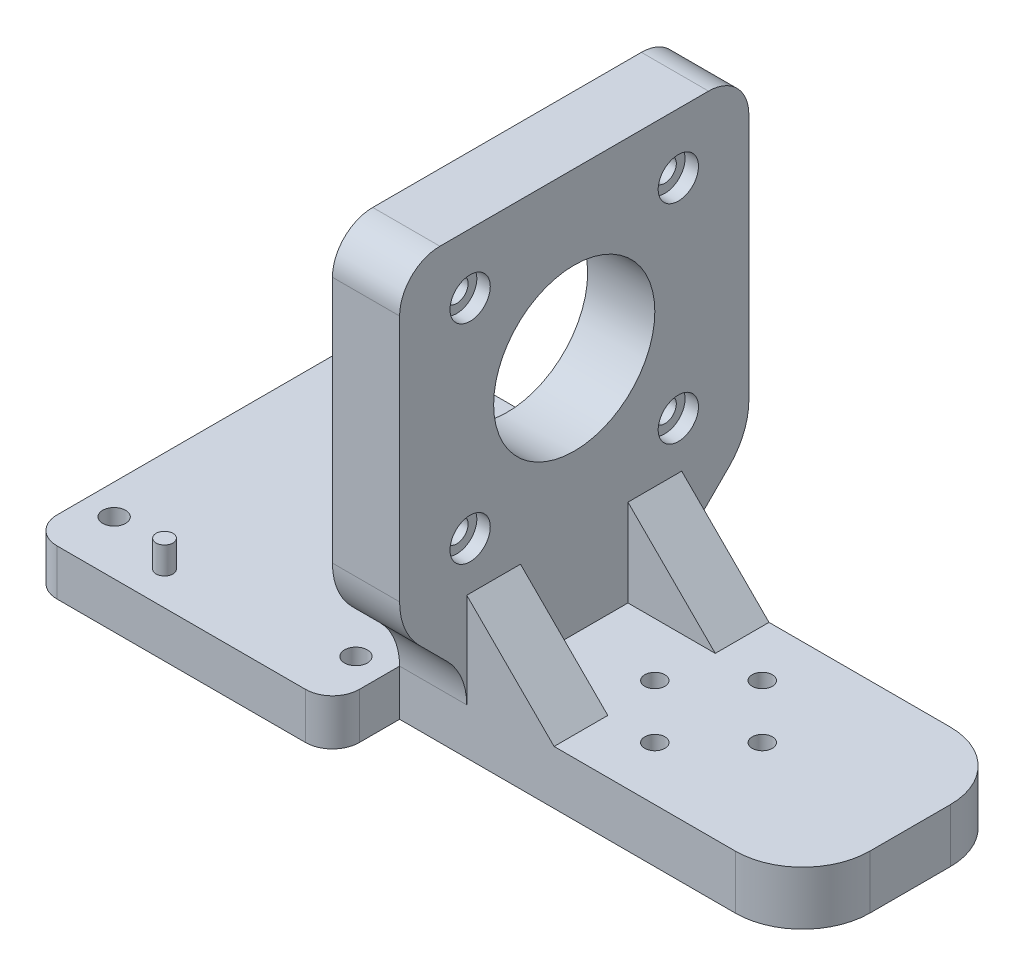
ISO-10303-21;
HEADER;
FILE_DESCRIPTION(('STEP AP214'),'2;1');
FILE_NAME('part.step','',(''),(''),'','','');
FILE_SCHEMA(('AUTOMOTIVE_DESIGN { 1 0 10303 214 1 1 1 1 }'));
ENDSEC;
DATA;
#1=APPLICATION_CONTEXT('core data for automotive mechanical design processes');
#2=APPLICATION_PROTOCOL_DEFINITION('international standard','automotive_design',2000,#1);
#3=PRODUCT_CONTEXT('',#1,'mechanical');
#4=PRODUCT('Part','Part','',(#3));
#5=PRODUCT_RELATED_PRODUCT_CATEGORY('part','',(#4));
#6=PRODUCT_DEFINITION_FORMATION('','',#4);
#7=PRODUCT_DEFINITION_CONTEXT('part definition',#1,'design');
#8=PRODUCT_DEFINITION('design','',#6,#7);
#9=PRODUCT_DEFINITION_SHAPE('','',#8);
#10=(LENGTH_UNIT() NAMED_UNIT(*) SI_UNIT(.MILLI.,.METRE.));
#11=(NAMED_UNIT(*) PLANE_ANGLE_UNIT() SI_UNIT($,.RADIAN.));
#12=(NAMED_UNIT(*) SI_UNIT($,.STERADIAN.) SOLID_ANGLE_UNIT());
#13=UNCERTAINTY_MEASURE_WITH_UNIT(LENGTH_MEASURE(1.E-05),#10,'distance_accuracy_value','');
#14=(GEOMETRIC_REPRESENTATION_CONTEXT(3) GLOBAL_UNCERTAINTY_ASSIGNED_CONTEXT((#13)) GLOBAL_UNIT_ASSIGNED_CONTEXT((#10,
#11,#12)) REPRESENTATION_CONTEXT('',''));
#15=CARTESIAN_POINT('',(0.,0.,0.));
#16=DIRECTION('',(0.,0.,1.));
#17=DIRECTION('',(1.,0.,0.));
#18=AXIS2_PLACEMENT_3D('',#15,#16,#17);
#19=CARTESIAN_POINT('',(-30.,-8.,-16.));
#20=DIRECTION('',(-1.,0.,0.));
#21=DIRECTION('',(0.,0.,1.));
#22=AXIS2_PLACEMENT_3D('',#19,#20,#21);
#23=PLANE('',#22);
#24=CARTESIAN_POINT('',(-30.,51.0710678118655,15.5));
#25=DIRECTION('',(1.,0.,0.));
#26=DIRECTION('',(0.,0.,-1.));
#27=AXIS2_PLACEMENT_3D('',#24,#25,#26);
#28=CIRCLE('',#27,1.70000000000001);
#29=CARTESIAN_POINT('',(-30.,51.0710678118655,13.8));
#30=VERTEX_POINT('',#29);
#31=EDGE_CURVE('E348',#30,#30,#28,.T.);
#32=ORIENTED_EDGE('',*,*,#31,.T.);
#33=EDGE_LOOP('',(#32));
#34=FACE_BOUND('',#33,.T.);
#35=CARTESIAN_POINT('',(-30.,51.0710678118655,-15.5));
#36=DIRECTION('',(1.,0.,0.));
#37=DIRECTION('',(0.,0.,-1.));
#38=AXIS2_PLACEMENT_3D('',#35,#36,#37);
#39=CIRCLE('',#38,1.70000000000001);
#40=CARTESIAN_POINT('',(-30.,51.0710678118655,-17.2));
#41=VERTEX_POINT('',#40);
#42=EDGE_CURVE('E360',#41,#41,#39,.T.);
#43=ORIENTED_EDGE('',*,*,#42,.T.);
#44=EDGE_LOOP('',(#43));
#45=FACE_BOUND('',#44,.T.);
#46=CARTESIAN_POINT('',(-30.,20.0710678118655,-15.5));
#47=DIRECTION('',(1.,0.,0.));
#48=DIRECTION('',(0.,0.,-1.));
#49=AXIS2_PLACEMENT_3D('',#46,#47,#48);
#50=CIRCLE('',#49,1.70000000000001);
#51=CARTESIAN_POINT('',(-30.,20.0710678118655,-17.2));
#52=VERTEX_POINT('',#51);
#53=EDGE_CURVE('E372',#52,#52,#50,.T.);
#54=ORIENTED_EDGE('',*,*,#53,.T.);
#55=EDGE_LOOP('',(#54));
#56=FACE_BOUND('',#55,.T.);
#57=CARTESIAN_POINT('',(-30.,35.5710678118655,0.));
#58=DIRECTION('',(1.,0.,0.));
#59=DIRECTION('',(0.,0.,-1.));
#60=AXIS2_PLACEMENT_3D('',#57,#58,#59);
#61=CIRCLE('',#60,12.);
#62=CARTESIAN_POINT('',(-30.,35.5710678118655,-12.));
#63=VERTEX_POINT('',#62);
#64=EDGE_CURVE('E387',#63,#63,#61,.T.);
#65=ORIENTED_EDGE('',*,*,#64,.T.);
#66=EDGE_LOOP('',(#65));
#67=FACE_BOUND('',#66,.T.);
#68=CARTESIAN_POINT('',(-30.,20.0710678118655,15.5));
#69=DIRECTION('',(1.,0.,0.));
#70=DIRECTION('',(0.,0.,-1.));
#71=AXIS2_PLACEMENT_3D('',#68,#69,#70);
#72=CIRCLE('',#71,1.70000000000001);
#73=CARTESIAN_POINT('',(-30.,20.0710678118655,13.8));
#74=VERTEX_POINT('',#73);
#75=EDGE_CURVE('E384',#74,#74,#72,.T.);
#76=ORIENTED_EDGE('',*,*,#75,.T.);
#77=EDGE_LOOP('',(#76));
#78=FACE_BOUND('',#77,.T.);
#79=DIRECTION('',(0.,0.,-1.));
#80=VECTOR('',#79,1.);
#81=CARTESIAN_POINT('',(-30.,10.0710678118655,7.));
#82=LINE('',#81,#80);
#83=CARTESIAN_POINT('',(-30.,10.0710678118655,7.));
#84=VERTEX_POINT('',#83);
#85=CARTESIAN_POINT('',(-30.,10.0710678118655,-7.));
#86=VERTEX_POINT('',#85);
#87=EDGE_CURVE('E259',#84,#86,#82,.T.);
#88=ORIENTED_EDGE('',*,*,#87,.F.);
#89=DIRECTION('',(0.,1.,0.));
#90=VECTOR('',#89,1.);
#91=CARTESIAN_POINT('',(-30.,-1.14213562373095,7.));
#92=LINE('',#91,#90);
#93=CARTESIAN_POINT('',(-30.,-1.14213562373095,7.));
#94=VERTEX_POINT('',#93);
#95=EDGE_CURVE('E265',#94,#84,#92,.T.);
#96=ORIENTED_EDGE('',*,*,#95,.F.);
#97=DIRECTION('',(0.,0.,-1.));
#98=VECTOR('',#97,1.);
#99=CARTESIAN_POINT('',(-30.,-1.14213562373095,-16.));
#100=LINE('',#99,#98);
#101=CARTESIAN_POINT('',(-30.,-1.14213562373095,16.));
#102=VERTEX_POINT('',#101);
#103=EDGE_CURVE('E335',#102,#94,#100,.T.);
#104=ORIENTED_EDGE('',*,*,#103,.F.);
#105=CARTESIAN_POINT('',(-30.,-1.14213562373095,26.));
#106=DIRECTION('',(-1.,0.,0.));
#107=DIRECTION('',(0.,0.,1.));
#108=AXIS2_PLACEMENT_3D('',#105,#106,#107);
#109=CIRCLE('',#108,10.);
#110=CARTESIAN_POINT('',(-30.,5.92893218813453,18.9289321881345));
#111=VERTEX_POINT('',#110);
#112=EDGE_CURVE('E520',#102,#111,#109,.F.);
#113=ORIENTED_EDGE('',*,*,#112,.T.);
#114=DIRECTION('',(0.,-0.707106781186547,-0.707106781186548));
#115=VECTOR('',#114,1.);
#116=CARTESIAN_POINT('',(-30.,13.,26.));
#117=LINE('',#116,#115);
#118=CARTESIAN_POINT('',(-30.,10.0710678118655,23.0710678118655));
#119=VERTEX_POINT('',#118);
#120=EDGE_CURVE('E394',#119,#111,#117,.T.);
#121=ORIENTED_EDGE('',*,*,#120,.F.);
#122=CARTESIAN_POINT('',(-30.,17.1421356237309,16.));
#123=DIRECTION('',(-1.,0.,0.));
#124=DIRECTION('',(0.,0.,1.));
#125=AXIS2_PLACEMENT_3D('',#122,#123,#124);
#126=CIRCLE('',#125,10.);
#127=CARTESIAN_POINT('',(-30.,17.1421356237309,26.));
#128=VERTEX_POINT('',#127);
#129=EDGE_CURVE('E548',#119,#128,#126,.T.);
#130=ORIENTED_EDGE('',*,*,#129,.T.);
#131=DIRECTION('',(0.,-1.,0.));
#132=VECTOR('',#131,1.);
#133=CARTESIAN_POINT('',(-30.,13.,26.));
#134=LINE('',#133,#132);
#135=CARTESIAN_POINT('',(-30.,54.,26.));
#136=VERTEX_POINT('',#135);
#137=EDGE_CURVE('E411',#136,#128,#134,.T.);
#138=ORIENTED_EDGE('',*,*,#137,.F.);
#139=CARTESIAN_POINT('',(-30.,54.,20.));
#140=DIRECTION('',(-1.,0.,0.));
#141=DIRECTION('',(0.,0.,1.));
#142=AXIS2_PLACEMENT_3D('',#139,#140,#141);
#143=CIRCLE('',#142,6.);
#144=CARTESIAN_POINT('',(-30.,60.,20.));
#145=VERTEX_POINT('',#144);
#146=EDGE_CURVE('E563',#136,#145,#143,.T.);
#147=ORIENTED_EDGE('',*,*,#146,.T.);
#148=DIRECTION('',(0.,0.,1.));
#149=VECTOR('',#148,1.);
#150=CARTESIAN_POINT('',(-30.,60.,-16.));
#151=LINE('',#150,#149);
#152=CARTESIAN_POINT('',(-30.,60.,-20.));
#153=VERTEX_POINT('',#152);
#154=EDGE_CURVE('E437',#153,#145,#151,.T.);
#155=ORIENTED_EDGE('',*,*,#154,.F.);
#156=CARTESIAN_POINT('',(-30.,54.,-20.));
#157=DIRECTION('',(-1.,0.,0.));
#158=DIRECTION('',(0.,0.,1.));
#159=AXIS2_PLACEMENT_3D('',#156,#157,#158);
#160=CIRCLE('',#159,6.);
#161=CARTESIAN_POINT('',(-30.,54.,-26.));
#162=VERTEX_POINT('',#161);
#163=EDGE_CURVE('E561',#153,#162,#160,.T.);
#164=ORIENTED_EDGE('',*,*,#163,.T.);
#165=DIRECTION('',(0.,-1.,0.));
#166=VECTOR('',#165,1.);
#167=CARTESIAN_POINT('',(-30.,13.,-26.));
#168=LINE('',#167,#166);
#169=CARTESIAN_POINT('',(-30.,17.1421356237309,-26.));
#170=VERTEX_POINT('',#169);
#171=EDGE_CURVE('E406',#162,#170,#168,.T.);
#172=ORIENTED_EDGE('',*,*,#171,.T.);
#173=CARTESIAN_POINT('',(-30.,17.1421356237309,-16.));
#174=DIRECTION('',(-1.,0.,0.));
#175=DIRECTION('',(0.,0.,1.));
#176=AXIS2_PLACEMENT_3D('',#173,#174,#175);
#177=CIRCLE('',#176,10.);
#178=CARTESIAN_POINT('',(-30.,10.0710678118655,-23.0710678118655));
#179=VERTEX_POINT('',#178);
#180=EDGE_CURVE('E551',#170,#179,#177,.T.);
#181=ORIENTED_EDGE('',*,*,#180,.T.);
#182=DIRECTION('',(0.,-0.707106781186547,0.707106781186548));
#183=VECTOR('',#182,1.);
#184=CARTESIAN_POINT('',(-30.,13.,-26.));
#185=LINE('',#184,#183);
#186=CARTESIAN_POINT('',(-30.,5.92893218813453,-18.9289321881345));
#187=VERTEX_POINT('',#186);
#188=EDGE_CURVE('E396',#179,#187,#185,.T.);
#189=ORIENTED_EDGE('',*,*,#188,.T.);
#190=CARTESIAN_POINT('',(-30.,-1.14213562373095,-26.));
#191=DIRECTION('',(-1.,0.,0.));
#192=DIRECTION('',(0.,0.,1.));
#193=AXIS2_PLACEMENT_3D('',#190,#191,#192);
#194=CIRCLE('',#193,10.);
#195=CARTESIAN_POINT('',(-30.,-1.14213562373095,-16.));
#196=VERTEX_POINT('',#195);
#197=EDGE_CURVE('E532',#187,#196,#194,.F.);
#198=ORIENTED_EDGE('',*,*,#197,.T.);
#199=CARTESIAN_POINT('',(-30.,-1.14213562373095,-7.));
#200=VERTEX_POINT('',#199);
#201=EDGE_CURVE('E330',#200,#196,#100,.T.);
#202=ORIENTED_EDGE('',*,*,#201,.F.);
#203=DIRECTION('',(0.,1.,0.));
#204=VECTOR('',#203,1.);
#205=CARTESIAN_POINT('',(-30.,-1.14213562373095,-7.));
#206=LINE('',#205,#204);
#207=EDGE_CURVE('E52',#200,#86,#206,.T.);
#208=ORIENTED_EDGE('',*,*,#207,.T.);
#209=EDGE_LOOP('',(#88,#96,#104,#113,#121,#130,#138,#147,#155,#164,#172,#181,#189,#198,#202,#208));
#210=FACE_BOUND('',#209,.T.);
#211=ADVANCED_FACE('F37',(#34,#45,#56,#67,#78,#210),#23,.T.);
#212=CARTESIAN_POINT('',(-75.,-1.14213562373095,-16.));
#213=DIRECTION('',(0.,-1.,0.));
#214=DIRECTION('',(0.,0.,-1.));
#215=AXIS2_PLACEMENT_3D('',#212,#213,#214);
#216=PLANE('',#215);
#217=CARTESIAN_POINT('',(-70.5,-1.14213562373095,-18.));
#218=DIRECTION('',(0.,1.,0.));
#219=DIRECTION('',(0.,0.,1.));
#220=AXIS2_PLACEMENT_3D('',#217,#218,#219);
#221=CIRCLE('',#220,1.7);
#222=CARTESIAN_POINT('',(-70.5,-1.14213562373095,-16.3));
#223=VERTEX_POINT('',#222);
#224=EDGE_CURVE('E286',#223,#223,#221,.T.);
#225=ORIENTED_EDGE('',*,*,#224,.F.);
#226=EDGE_LOOP('',(#225));
#227=FACE_BOUND('',#226,.T.);
#228=CARTESIAN_POINT('',(-34.5,-1.14213562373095,-18.));
#229=DIRECTION('',(0.,1.,0.));
#230=DIRECTION('',(0.,0.,-1.));
#231=AXIS2_PLACEMENT_3D('',#228,#229,#230);
#232=CIRCLE('',#231,1.7);
#233=CARTESIAN_POINT('',(-34.5,-1.14213562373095,-19.7));
#234=VERTEX_POINT('',#233);
#235=EDGE_CURVE('E283',#234,#234,#232,.T.);
#236=ORIENTED_EDGE('',*,*,#235,.F.);
#237=EDGE_LOOP('',(#236));
#238=FACE_BOUND('',#237,.T.);
#239=CARTESIAN_POINT('',(-34.5,-1.14213562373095,18.));
#240=DIRECTION('',(0.,1.,0.));
#241=DIRECTION('',(0.,0.,1.));
#242=AXIS2_PLACEMENT_3D('',#239,#240,#241);
#243=CIRCLE('',#242,1.7);
#244=CARTESIAN_POINT('',(-34.5,-1.14213562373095,19.7));
#245=VERTEX_POINT('',#244);
#246=EDGE_CURVE('E287',#245,#245,#243,.T.);
#247=ORIENTED_EDGE('',*,*,#246,.F.);
#248=EDGE_LOOP('',(#247));
#249=FACE_BOUND('',#248,.T.);
#250=CARTESIAN_POINT('',(-70.5,-1.14213562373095,18.));
#251=DIRECTION('',(0.,1.,0.));
#252=DIRECTION('',(0.,0.,-1.));
#253=AXIS2_PLACEMENT_3D('',#250,#251,#252);
#254=CIRCLE('',#253,1.69999999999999);
#255=CARTESIAN_POINT('',(-70.5,-1.14213562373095,16.3));
#256=VERTEX_POINT('',#255);
#257=EDGE_CURVE('E278',#256,#256,#254,.T.);
#258=ORIENTED_EDGE('',*,*,#257,.F.);
#259=EDGE_LOOP('',(#258));
#260=FACE_BOUND('',#259,.T.);
#261=CARTESIAN_POINT('',(-60.,-1.14213562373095,21.));
#262=DIRECTION('',(0.,-1.,0.));
#263=DIRECTION('',(0.,0.,-1.));
#264=AXIS2_PLACEMENT_3D('',#261,#262,#263);
#265=CIRCLE('',#264,1.25);
#266=CARTESIAN_POINT('',(-60.,-1.14213562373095,19.75));
#267=VERTEX_POINT('',#266);
#268=EDGE_CURVE('E11',#267,#267,#265,.F.);
#269=ORIENTED_EDGE('',*,*,#268,.F.);
#270=EDGE_LOOP('',(#269));
#271=FACE_BOUND('',#270,.T.);
#272=DIRECTION('',(1.,0.,0.));
#273=VECTOR('',#272,1.);
#274=CARTESIAN_POINT('',(-41.2132034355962,-1.14213562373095,7.));
#275=LINE('',#274,#273);
#276=CARTESIAN_POINT('',(-41.2132034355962,-1.14213562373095,7.));
#277=VERTEX_POINT('',#276);
#278=EDGE_CURVE('E264',#277,#94,#275,.T.);
#279=ORIENTED_EDGE('',*,*,#278,.F.);
#280=DIRECTION('',(0.,0.,-1.));
#281=VECTOR('',#280,1.);
#282=CARTESIAN_POINT('',(-41.2132034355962,-1.14213562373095,7.));
#283=LINE('',#282,#281);
#284=CARTESIAN_POINT('',(-41.2132034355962,-1.14213562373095,-7.));
#285=VERTEX_POINT('',#284);
#286=EDGE_CURVE('E261',#277,#285,#283,.T.);
#287=ORIENTED_EDGE('',*,*,#286,.T.);
#288=DIRECTION('',(1.,0.,0.));
#289=VECTOR('',#288,1.);
#290=CARTESIAN_POINT('',(-41.2132034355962,-1.14213562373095,-7.));
#291=LINE('',#290,#289);
#292=EDGE_CURVE('E272',#285,#200,#291,.T.);
#293=ORIENTED_EDGE('',*,*,#292,.T.);
#294=ORIENTED_EDGE('',*,*,#201,.T.);
#295=DIRECTION('',(0.,0.,1.));
#296=VECTOR('',#295,1.);
#297=CARTESIAN_POINT('',(-30.,-1.14213562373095,-26.));
#298=LINE('',#297,#296);
#299=CARTESIAN_POINT('',(-30.,-1.14213562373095,-22.));
#300=VERTEX_POINT('',#299);
#301=EDGE_CURVE('E320',#300,#196,#298,.T.);
#302=ORIENTED_EDGE('',*,*,#301,.F.);
#303=CARTESIAN_POINT('',(-34.,-1.14213562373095,-22.));
#304=DIRECTION('',(0.,-1.,0.));
#305=DIRECTION('',(0.,0.,-1.));
#306=AXIS2_PLACEMENT_3D('',#303,#304,#305);
#307=CIRCLE('',#306,4.);
#308=CARTESIAN_POINT('',(-34.,-1.14213562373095,-26.));
#309=VERTEX_POINT('',#308);
#310=EDGE_CURVE('E587',#300,#309,#307,.F.);
#311=ORIENTED_EDGE('',*,*,#310,.T.);
#312=DIRECTION('',(1.,0.,0.));
#313=VECTOR('',#312,1.);
#314=CARTESIAN_POINT('',(-75.,-1.14213562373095,-26.));
#315=LINE('',#314,#313);
#316=CARTESIAN_POINT('',(-71.,-1.14213562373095,-26.));
#317=VERTEX_POINT('',#316);
#318=EDGE_CURVE('E306',#317,#309,#315,.T.);
#319=ORIENTED_EDGE('',*,*,#318,.F.);
#320=CARTESIAN_POINT('',(-71.,-1.14213562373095,-22.));
#321=DIRECTION('',(0.,-1.,0.));
#322=DIRECTION('',(0.,0.,-1.));
#323=AXIS2_PLACEMENT_3D('',#320,#321,#322);
#324=CIRCLE('',#323,4.);
#325=CARTESIAN_POINT('',(-75.,-1.14213562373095,-22.));
#326=VERTEX_POINT('',#325);
#327=EDGE_CURVE('E585',#317,#326,#324,.F.);
#328=ORIENTED_EDGE('',*,*,#327,.T.);
#329=DIRECTION('',(0.,0.,-1.));
#330=VECTOR('',#329,1.);
#331=CARTESIAN_POINT('',(-75.,-1.14213562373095,-16.));
#332=LINE('',#331,#330);
#333=CARTESIAN_POINT('',(-75.,-1.14213562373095,22.));
#334=VERTEX_POINT('',#333);
#335=EDGE_CURVE('E334',#334,#326,#332,.T.);
#336=ORIENTED_EDGE('',*,*,#335,.F.);
#337=CARTESIAN_POINT('',(-71.,-1.14213562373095,22.));
#338=DIRECTION('',(0.,-1.,0.));
#339=DIRECTION('',(0.,0.,-1.));
#340=AXIS2_PLACEMENT_3D('',#337,#338,#339);
#341=CIRCLE('',#340,4.);
#342=CARTESIAN_POINT('',(-71.,-1.14213562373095,26.));
#343=VERTEX_POINT('',#342);
#344=EDGE_CURVE('E583',#334,#343,#341,.F.);
#345=ORIENTED_EDGE('',*,*,#344,.T.);
#346=DIRECTION('',(1.,0.,0.));
#347=VECTOR('',#346,1.);
#348=CARTESIAN_POINT('',(-75.,-1.14213562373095,26.));
#349=LINE('',#348,#347);
#350=CARTESIAN_POINT('',(-34.,-1.14213562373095,26.));
#351=VERTEX_POINT('',#350);
#352=EDGE_CURVE('E311',#343,#351,#349,.T.);
#353=ORIENTED_EDGE('',*,*,#352,.T.);
#354=CARTESIAN_POINT('',(-34.,-1.14213562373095,22.));
#355=DIRECTION('',(0.,-1.,0.));
#356=DIRECTION('',(0.,0.,-1.));
#357=AXIS2_PLACEMENT_3D('',#354,#355,#356);
#358=CIRCLE('',#357,4.);
#359=CARTESIAN_POINT('',(-30.,-1.14213562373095,22.));
#360=VERTEX_POINT('',#359);
#361=EDGE_CURVE('E581',#351,#360,#358,.F.);
#362=ORIENTED_EDGE('',*,*,#361,.T.);
#363=EDGE_CURVE('E319',#102,#360,#298,.T.);
#364=ORIENTED_EDGE('',*,*,#363,.F.);
#365=ORIENTED_EDGE('',*,*,#103,.T.);
#366=EDGE_LOOP('',(#279,#287,#293,#294,#302,#311,#319,#328,#336,#345,#353,#362,#364,#365));
#367=FACE_BOUND('',#366,.T.);
#368=ADVANCED_FACE('F625',(#227,#238,#249,#260,#271,#367),#216,.F.);
#369=CARTESIAN_POINT('',(-30.,-8.,16.));
#370=DIRECTION('',(0.,0.,1.));
#371=DIRECTION('',(1.,0.,0.));
#372=AXIS2_PLACEMENT_3D('',#369,#370,#371);
#373=PLANE('',#372);
#374=DIRECTION('',(-1.,0.,0.));
#375=VECTOR('',#374,1.);
#376=CARTESIAN_POINT('',(-30.,-1.14213562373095,16.));
#377=LINE('',#376,#375);
#378=CARTESIAN_POINT('',(-20.,-1.14213562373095,16.));
#379=VERTEX_POINT('',#378);
#380=EDGE_CURVE('E514',#379,#102,#377,.T.);
#381=ORIENTED_EDGE('',*,*,#380,.T.);
#382=DIRECTION('',(0.,-1.,0.));
#383=VECTOR('',#382,1.);
#384=CARTESIAN_POINT('',(-30.,-8.,16.));
#385=LINE('',#384,#383);
#386=CARTESIAN_POINT('',(-30.,-8.,16.));
#387=VERTEX_POINT('',#386);
#388=EDGE_CURVE('E327',#102,#387,#385,.T.);
#389=ORIENTED_EDGE('',*,*,#388,.T.);
#390=DIRECTION('',(1.,0.,0.));
#391=VECTOR('',#390,1.);
#392=CARTESIAN_POINT('',(-30.,-8.,16.));
#393=LINE('',#392,#391);
#394=CARTESIAN_POINT('',(20.,-8.,16.));
#395=VERTEX_POINT('',#394);
#396=EDGE_CURVE('E476',#387,#395,#393,.T.);
#397=ORIENTED_EDGE('',*,*,#396,.T.);
#398=DIRECTION('',(0.,1.,0.));
#399=VECTOR('',#398,1.);
#400=CARTESIAN_POINT('',(20.,-8.,16.));
#401=LINE('',#400,#399);
#402=CARTESIAN_POINT('',(20.,0.,16.));
#403=VERTEX_POINT('',#402);
#404=EDGE_CURVE('E495',#395,#403,#401,.T.);
#405=ORIENTED_EDGE('',*,*,#404,.T.);
#406=DIRECTION('',(1.,0.,0.));
#407=VECTOR('',#406,1.);
#408=CARTESIAN_POINT('',(-30.,0.,16.));
#409=LINE('',#408,#407);
#410=CARTESIAN_POINT('',(-7.,0.,16.));
#411=VERTEX_POINT('',#410);
#412=EDGE_CURVE('E473',#411,#403,#409,.T.);
#413=ORIENTED_EDGE('',*,*,#412,.F.);
#414=DIRECTION('',(0.707106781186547,-0.707106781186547,0.));
#415=VECTOR('',#414,1.);
#416=CARTESIAN_POINT('',(-20.,13.,16.));
#417=LINE('',#416,#415);
#418=CARTESIAN_POINT('',(-20.,13.,16.));
#419=VERTEX_POINT('',#418);
#420=EDGE_CURVE('E426',#419,#411,#417,.T.);
#421=ORIENTED_EDGE('',*,*,#420,.F.);
#422=DIRECTION('',(0.,1.,0.));
#423=VECTOR('',#422,1.);
#424=CARTESIAN_POINT('',(-20.,3.,16.));
#425=LINE('',#424,#423);
#426=EDGE_CURVE('E391',#379,#419,#425,.T.);
#427=ORIENTED_EDGE('',*,*,#426,.F.);
#428=EDGE_LOOP('',(#381,#389,#397,#405,#413,#421,#427));
#429=FACE_BOUND('',#428,.T.);
#430=ADVANCED_FACE('F673',(#429),#373,.T.);
#431=CARTESIAN_POINT('',(-30.,-8.,-16.));
#432=DIRECTION('',(0.,0.,-1.));
#433=DIRECTION('',(-1.,0.,0.));
#434=AXIS2_PLACEMENT_3D('',#431,#432,#433);
#435=PLANE('',#434);
#436=DIRECTION('',(-1.,0.,0.));
#437=VECTOR('',#436,1.);
#438=CARTESIAN_POINT('',(-30.,-8.,-16.));
#439=LINE('',#438,#437);
#440=CARTESIAN_POINT('',(20.,-8.,-16.));
#441=VERTEX_POINT('',#440);
#442=CARTESIAN_POINT('',(-30.,-8.,-16.));
#443=VERTEX_POINT('',#442);
#444=EDGE_CURVE('E472',#441,#443,#439,.T.);
#445=ORIENTED_EDGE('',*,*,#444,.T.);
#446=DIRECTION('',(0.,1.,0.));
#447=VECTOR('',#446,1.);
#448=CARTESIAN_POINT('',(-30.,-8.,-16.));
#449=LINE('',#448,#447);
#450=EDGE_CURVE('E316',#443,#196,#449,.T.);
#451=ORIENTED_EDGE('',*,*,#450,.T.);
#452=DIRECTION('',(-1.,0.,0.));
#453=VECTOR('',#452,1.);
#454=CARTESIAN_POINT('',(-20.,-1.14213562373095,-16.));
#455=LINE('',#454,#453);
#456=CARTESIAN_POINT('',(-20.,-1.14213562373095,-16.));
#457=VERTEX_POINT('',#456);
#458=EDGE_CURVE('E529',#196,#457,#455,.F.);
#459=ORIENTED_EDGE('',*,*,#458,.T.);
#460=DIRECTION('',(0.,1.,0.));
#461=VECTOR('',#460,1.);
#462=CARTESIAN_POINT('',(-20.,3.,-16.));
#463=LINE('',#462,#461);
#464=CARTESIAN_POINT('',(-20.,13.,-16.));
#465=VERTEX_POINT('',#464);
#466=EDGE_CURVE('E400',#457,#465,#463,.T.);
#467=ORIENTED_EDGE('',*,*,#466,.T.);
#468=DIRECTION('',(0.707106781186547,-0.707106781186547,0.));
#469=VECTOR('',#468,1.);
#470=CARTESIAN_POINT('',(-20.,13.,-16.));
#471=LINE('',#470,#469);
#472=CARTESIAN_POINT('',(-7.,0.,-16.));
#473=VERTEX_POINT('',#472);
#474=EDGE_CURVE('E414',#465,#473,#471,.T.);
#475=ORIENTED_EDGE('',*,*,#474,.T.);
#476=DIRECTION('',(-1.,0.,0.));
#477=VECTOR('',#476,1.);
#478=CARTESIAN_POINT('',(-30.,0.,-16.));
#479=LINE('',#478,#477);
#480=CARTESIAN_POINT('',(20.,0.,-16.));
#481=VERTEX_POINT('',#480);
#482=EDGE_CURVE('E481',#481,#473,#479,.T.);
#483=ORIENTED_EDGE('',*,*,#482,.F.);
#484=DIRECTION('',(0.,1.,0.));
#485=VECTOR('',#484,1.);
#486=CARTESIAN_POINT('',(20.,-8.,-16.));
#487=LINE('',#486,#485);
#488=EDGE_CURVE('E510',#481,#441,#487,.F.);
#489=ORIENTED_EDGE('',*,*,#488,.T.);
#490=EDGE_LOOP('',(#445,#451,#459,#467,#475,#483,#489));
#491=FACE_BOUND('',#490,.T.);
#492=ADVANCED_FACE('F656',(#491),#435,.T.);
#493=CARTESIAN_POINT('',(-20.,60.,-16.));
#494=DIRECTION('',(-1.,0.,0.));
#495=DIRECTION('',(0.,0.,1.));
#496=AXIS2_PLACEMENT_3D('',#493,#494,#495);
#497=PLANE('',#496);
#498=CARTESIAN_POINT('',(-20.,51.0710678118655,15.5));
#499=DIRECTION('',(1.,0.,0.));
#500=DIRECTION('',(0.,0.,-1.));
#501=AXIS2_PLACEMENT_3D('',#498,#499,#500);
#502=CIRCLE('',#501,3.);
#503=CARTESIAN_POINT('',(-20.,51.0710678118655,12.5));
#504=VERTEX_POINT('',#503);
#505=EDGE_CURVE('E338',#504,#504,#502,.T.);
#506=ORIENTED_EDGE('',*,*,#505,.F.);
#507=EDGE_LOOP('',(#506));
#508=FACE_BOUND('',#507,.T.);
#509=CARTESIAN_POINT('',(-20.,51.0710678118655,-15.5));
#510=DIRECTION('',(1.,0.,0.));
#511=DIRECTION('',(0.,0.,-1.));
#512=AXIS2_PLACEMENT_3D('',#509,#510,#511);
#513=CIRCLE('',#512,3.);
#514=CARTESIAN_POINT('',(-20.,51.0710678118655,-18.5));
#515=VERTEX_POINT('',#514);
#516=EDGE_CURVE('E351',#515,#515,#513,.T.);
#517=ORIENTED_EDGE('',*,*,#516,.F.);
#518=EDGE_LOOP('',(#517));
#519=FACE_BOUND('',#518,.T.);
#520=CARTESIAN_POINT('',(-20.,20.0710678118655,-15.5));
#521=DIRECTION('',(1.,0.,0.));
#522=DIRECTION('',(0.,0.,-1.));
#523=AXIS2_PLACEMENT_3D('',#520,#521,#522);
#524=CIRCLE('',#523,3.);
#525=CARTESIAN_POINT('',(-20.,20.0710678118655,-18.5));
#526=VERTEX_POINT('',#525);
#527=EDGE_CURVE('E363',#526,#526,#524,.T.);
#528=ORIENTED_EDGE('',*,*,#527,.F.);
#529=EDGE_LOOP('',(#528));
#530=FACE_BOUND('',#529,.T.);
#531=CARTESIAN_POINT('',(-20.,35.5710678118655,0.));
#532=DIRECTION('',(-1.,0.,0.));
#533=DIRECTION('',(0.,0.,1.));
#534=AXIS2_PLACEMENT_3D('',#531,#532,#533);
#535=CIRCLE('',#534,12.);
#536=CARTESIAN_POINT('',(-20.,35.5710678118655,12.));
#537=VERTEX_POINT('',#536);
#538=EDGE_CURVE('E390',#537,#537,#535,.T.);
#539=ORIENTED_EDGE('',*,*,#538,.T.);
#540=EDGE_LOOP('',(#539));
#541=FACE_BOUND('',#540,.T.);
#542=DIRECTION('',(0.,0.,-1.));
#543=VECTOR('',#542,1.);
#544=CARTESIAN_POINT('',(-20.,60.,-16.));
#545=LINE('',#544,#543);
#546=CARTESIAN_POINT('',(-20.,60.,20.));
#547=VERTEX_POINT('',#546);
#548=CARTESIAN_POINT('',(-20.,60.,-20.));
#549=VERTEX_POINT('',#548);
#550=EDGE_CURVE('E440',#547,#549,#545,.T.);
#551=ORIENTED_EDGE('',*,*,#550,.F.);
#552=CARTESIAN_POINT('',(-20.,54.,20.));
#553=DIRECTION('',(-1.,0.,0.));
#554=DIRECTION('',(0.,0.,1.));
#555=AXIS2_PLACEMENT_3D('',#552,#553,#554);
#556=CIRCLE('',#555,6.);
#557=CARTESIAN_POINT('',(-20.,54.,26.));
#558=VERTEX_POINT('',#557);
#559=EDGE_CURVE('E572',#547,#558,#556,.F.);
#560=ORIENTED_EDGE('',*,*,#559,.T.);
#561=DIRECTION('',(0.,1.,0.));
#562=VECTOR('',#561,1.);
#563=CARTESIAN_POINT('',(-20.,60.,26.));
#564=LINE('',#563,#562);
#565=CARTESIAN_POINT('',(-20.,17.1421356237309,26.));
#566=VERTEX_POINT('',#565);
#567=EDGE_CURVE('E408',#566,#558,#564,.T.);
#568=ORIENTED_EDGE('',*,*,#567,.F.);
#569=CARTESIAN_POINT('',(-20.,17.1421356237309,16.));
#570=DIRECTION('',(-1.,0.,0.));
#571=DIRECTION('',(0.,0.,1.));
#572=AXIS2_PLACEMENT_3D('',#569,#570,#571);
#573=CIRCLE('',#572,10.);
#574=CARTESIAN_POINT('',(-20.,10.0710678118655,23.0710678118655));
#575=VERTEX_POINT('',#574);
#576=EDGE_CURVE('E541',#566,#575,#573,.F.);
#577=ORIENTED_EDGE('',*,*,#576,.T.);
#578=DIRECTION('',(0.,-0.707106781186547,-0.707106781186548));
#579=VECTOR('',#578,1.);
#580=CARTESIAN_POINT('',(-20.,13.,26.));
#581=LINE('',#580,#579);
#582=CARTESIAN_POINT('',(-20.,5.92893218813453,18.9289321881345));
#583=VERTEX_POINT('',#582);
#584=EDGE_CURVE('E393',#575,#583,#581,.T.);
#585=ORIENTED_EDGE('',*,*,#584,.T.);
#586=CARTESIAN_POINT('',(-20.,-1.14213562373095,26.));
#587=DIRECTION('',(-1.,0.,0.));
#588=DIRECTION('',(0.,0.,1.));
#589=AXIS2_PLACEMENT_3D('',#586,#587,#588);
#590=CIRCLE('',#589,10.);
#591=EDGE_CURVE('E523',#583,#379,#590,.T.);
#592=ORIENTED_EDGE('',*,*,#591,.T.);
#593=ORIENTED_EDGE('',*,*,#426,.T.);
#594=DIRECTION('',(0.,0.,1.));
#595=VECTOR('',#594,1.);
#596=CARTESIAN_POINT('',(-20.,13.,-16.));
#597=LINE('',#596,#595);
#598=CARTESIAN_POINT('',(-20.,13.,8.));
#599=VERTEX_POINT('',#598);
#600=EDGE_CURVE('E487',#419,#599,#597,.F.);
#601=ORIENTED_EDGE('',*,*,#600,.T.);
#602=DIRECTION('',(0.,1.,0.));
#603=VECTOR('',#602,1.);
#604=CARTESIAN_POINT('',(-20.,60.,8.));
#605=LINE('',#604,#603);
#606=CARTESIAN_POINT('',(-20.,0.,8.));
#607=VERTEX_POINT('',#606);
#608=EDGE_CURVE('E478',#607,#599,#605,.T.);
#609=ORIENTED_EDGE('',*,*,#608,.F.);
#610=DIRECTION('',(0.,0.,-1.));
#611=VECTOR('',#610,1.);
#612=CARTESIAN_POINT('',(-20.,0.,-16.));
#613=LINE('',#612,#611);
#614=CARTESIAN_POINT('',(-20.,0.,-8.));
#615=VERTEX_POINT('',#614);
#616=EDGE_CURVE('E436',#607,#615,#613,.T.);
#617=ORIENTED_EDGE('',*,*,#616,.T.);
#618=DIRECTION('',(0.,-1.,0.));
#619=VECTOR('',#618,1.);
#620=CARTESIAN_POINT('',(-20.,60.,-8.));
#621=LINE('',#620,#619);
#622=CARTESIAN_POINT('',(-20.,13.,-8.));
#623=VERTEX_POINT('',#622);
#624=EDGE_CURVE('E489',#623,#615,#621,.T.);
#625=ORIENTED_EDGE('',*,*,#624,.F.);
#626=DIRECTION('',(0.,0.,-1.));
#627=VECTOR('',#626,1.);
#628=CARTESIAN_POINT('',(-20.,13.,-16.));
#629=LINE('',#628,#627);
#630=EDGE_CURVE('E492',#623,#465,#629,.T.);
#631=ORIENTED_EDGE('',*,*,#630,.T.);
#632=ORIENTED_EDGE('',*,*,#466,.F.);
#633=CARTESIAN_POINT('',(-20.,-1.14213562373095,-26.));
#634=DIRECTION('',(-1.,0.,0.));
#635=DIRECTION('',(0.,0.,1.));
#636=AXIS2_PLACEMENT_3D('',#633,#634,#635);
#637=CIRCLE('',#636,10.);
#638=CARTESIAN_POINT('',(-20.,5.92893218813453,-18.9289321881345));
#639=VERTEX_POINT('',#638);
#640=EDGE_CURVE('E535',#457,#639,#637,.T.);
#641=ORIENTED_EDGE('',*,*,#640,.T.);
#642=DIRECTION('',(0.,-0.707106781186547,0.707106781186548));
#643=VECTOR('',#642,1.);
#644=CARTESIAN_POINT('',(-20.,13.,-26.));
#645=LINE('',#644,#643);
#646=CARTESIAN_POINT('',(-20.,10.0710678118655,-23.0710678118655));
#647=VERTEX_POINT('',#646);
#648=EDGE_CURVE('E398',#647,#639,#645,.T.);
#649=ORIENTED_EDGE('',*,*,#648,.F.);
#650=CARTESIAN_POINT('',(-20.,17.1421356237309,-16.));
#651=DIRECTION('',(-1.,0.,0.));
#652=DIRECTION('',(0.,0.,1.));
#653=AXIS2_PLACEMENT_3D('',#650,#651,#652);
#654=CIRCLE('',#653,10.);
#655=CARTESIAN_POINT('',(-20.,17.1421356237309,-26.));
#656=VERTEX_POINT('',#655);
#657=EDGE_CURVE('E543',#647,#656,#654,.F.);
#658=ORIENTED_EDGE('',*,*,#657,.T.);
#659=DIRECTION('',(0.,1.,0.));
#660=VECTOR('',#659,1.);
#661=CARTESIAN_POINT('',(-20.,60.,-26.));
#662=LINE('',#661,#660);
#663=CARTESIAN_POINT('',(-20.,54.,-26.));
#664=VERTEX_POINT('',#663);
#665=EDGE_CURVE('E402',#656,#664,#662,.T.);
#666=ORIENTED_EDGE('',*,*,#665,.T.);
#667=CARTESIAN_POINT('',(-20.,54.,-20.));
#668=DIRECTION('',(-1.,0.,0.));
#669=DIRECTION('',(0.,0.,1.));
#670=AXIS2_PLACEMENT_3D('',#667,#668,#669);
#671=CIRCLE('',#670,6.);
#672=EDGE_CURVE('E570',#664,#549,#671,.F.);
#673=ORIENTED_EDGE('',*,*,#672,.T.);
#674=EDGE_LOOP('',(#551,#560,#568,#577,#585,#592,#593,#601,#609,#617,#625,#631,#632,#641,#649,
#658,#666,#673));
#675=FACE_BOUND('',#674,.T.);
#676=CARTESIAN_POINT('',(-20.,20.0710678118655,15.5));
#677=DIRECTION('',(1.,0.,0.));
#678=DIRECTION('',(0.,0.,-1.));
#679=AXIS2_PLACEMENT_3D('',#676,#677,#678);
#680=CIRCLE('',#679,3.);
#681=CARTESIAN_POINT('',(-20.,20.0710678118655,12.5));
#682=VERTEX_POINT('',#681);
#683=EDGE_CURVE('E375',#682,#682,#680,.T.);
#684=ORIENTED_EDGE('',*,*,#683,.F.);
#685=EDGE_LOOP('',(#684));
#686=FACE_BOUND('',#685,.T.);
#687=ADVANCED_FACE('F688',(#508,#519,#530,#541,#675,#686),#497,.F.);
#688=CARTESIAN_POINT('',(30.,-8.,-16.));
#689=DIRECTION('',(1.,0.,0.));
#690=DIRECTION('',(0.,0.,-1.));
#691=AXIS2_PLACEMENT_3D('',#688,#689,#690);
#692=PLANE('',#691);
#693=DIRECTION('',(0.,0.,-1.));
#694=VECTOR('',#693,1.);
#695=CARTESIAN_POINT('',(30.,-8.,-16.));
#696=LINE('',#695,#694);
#697=CARTESIAN_POINT('',(30.,-8.,6.));
#698=VERTEX_POINT('',#697);
#699=CARTESIAN_POINT('',(30.,-8.,-6.));
#700=VERTEX_POINT('',#699);
#701=EDGE_CURVE('E469',#698,#700,#696,.T.);
#702=ORIENTED_EDGE('',*,*,#701,.T.);
#703=DIRECTION('',(0.,1.,0.));
#704=VECTOR('',#703,1.);
#705=CARTESIAN_POINT('',(30.,-8.,-6.));
#706=LINE('',#705,#704);
#707=CARTESIAN_POINT('',(30.,0.,-6.));
#708=VERTEX_POINT('',#707);
#709=EDGE_CURVE('E505',#700,#708,#706,.T.);
#710=ORIENTED_EDGE('',*,*,#709,.T.);
#711=DIRECTION('',(0.,0.,-1.));
#712=VECTOR('',#711,1.);
#713=CARTESIAN_POINT('',(30.,0.,-16.));
#714=LINE('',#713,#712);
#715=CARTESIAN_POINT('',(30.,0.,6.));
#716=VERTEX_POINT('',#715);
#717=EDGE_CURVE('E466',#716,#708,#714,.T.);
#718=ORIENTED_EDGE('',*,*,#717,.F.);
#719=DIRECTION('',(0.,1.,0.));
#720=VECTOR('',#719,1.);
#721=CARTESIAN_POINT('',(30.,-8.,6.));
#722=LINE('',#721,#720);
#723=EDGE_CURVE('E500',#716,#698,#722,.F.);
#724=ORIENTED_EDGE('',*,*,#723,.T.);
#725=EDGE_LOOP('',(#702,#710,#718,#724));
#726=FACE_BOUND('',#725,.T.);
#727=ADVANCED_FACE('F665',(#726),#692,.T.);
#728=CARTESIAN_POINT('',(0.,-8.,0.));
#729=DIRECTION('',(0.,1.,0.));
#730=DIRECTION('',(0.,0.,1.));
#731=AXIS2_PLACEMENT_3D('',#728,#729,#730);
#732=PLANE('',#731);
#733=CARTESIAN_POINT('',(-70.5,-8.,18.));
#734=DIRECTION('',(0.,1.,0.));
#735=DIRECTION('',(0.,0.,1.));
#736=AXIS2_PLACEMENT_3D('',#733,#734,#735);
#737=CIRCLE('',#736,1.69999999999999);
#738=CARTESIAN_POINT('',(-70.5,-8.,19.7));
#739=VERTEX_POINT('',#738);
#740=EDGE_CURVE('E303',#739,#739,#737,.T.);
#741=ORIENTED_EDGE('',*,*,#740,.T.);
#742=EDGE_LOOP('',(#741));
#743=FACE_BOUND('',#742,.T.);
#744=CARTESIAN_POINT('',(-34.5,-8.,18.));
#745=DIRECTION('',(0.,1.,0.));
#746=DIRECTION('',(0.,0.,1.));
#747=AXIS2_PLACEMENT_3D('',#744,#745,#746);
#748=CIRCLE('',#747,1.7);
#749=CARTESIAN_POINT('',(-34.5,-8.,19.7));
#750=VERTEX_POINT('',#749);
#751=EDGE_CURVE('E300',#750,#750,#748,.T.);
#752=ORIENTED_EDGE('',*,*,#751,.T.);
#753=EDGE_LOOP('',(#752));
#754=FACE_BOUND('',#753,.T.);
#755=CARTESIAN_POINT('',(-34.5,-8.,-18.));
#756=DIRECTION('',(0.,1.,0.));
#757=DIRECTION('',(0.,0.,1.));
#758=AXIS2_PLACEMENT_3D('',#755,#756,#757);
#759=CIRCLE('',#758,1.7);
#760=CARTESIAN_POINT('',(-34.5,-8.,-16.3));
#761=VERTEX_POINT('',#760);
#762=EDGE_CURVE('E297',#761,#761,#759,.T.);
#763=ORIENTED_EDGE('',*,*,#762,.T.);
#764=EDGE_LOOP('',(#763));
#765=FACE_BOUND('',#764,.T.);
#766=CARTESIAN_POINT('',(-70.5,-8.,-18.));
#767=DIRECTION('',(0.,1.,0.));
#768=DIRECTION('',(0.,0.,1.));
#769=AXIS2_PLACEMENT_3D('',#766,#767,#768);
#770=CIRCLE('',#769,1.7);
#771=CARTESIAN_POINT('',(-70.5,-8.,-16.3));
#772=VERTEX_POINT('',#771);
#773=EDGE_CURVE('E294',#772,#772,#770,.T.);
#774=ORIENTED_EDGE('',*,*,#773,.T.);
#775=EDGE_LOOP('',(#774));
#776=FACE_BOUND('',#775,.T.);
#777=DIRECTION('',(1.,0.,0.));
#778=VECTOR('',#777,1.);
#779=CARTESIAN_POINT('',(-75.,-8.,-26.));
#780=LINE('',#779,#778);
#781=CARTESIAN_POINT('',(-71.,-8.,-26.));
#782=VERTEX_POINT('',#781);
#783=CARTESIAN_POINT('',(-34.,-8.,-26.));
#784=VERTEX_POINT('',#783);
#785=EDGE_CURVE('E307',#782,#784,#780,.T.);
#786=ORIENTED_EDGE('',*,*,#785,.T.);
#787=CARTESIAN_POINT('',(-34.,-8.,-22.));
#788=DIRECTION('',(0.,1.,0.));
#789=DIRECTION('',(0.,0.,1.));
#790=AXIS2_PLACEMENT_3D('',#787,#788,#789);
#791=CIRCLE('',#790,4.);
#792=CARTESIAN_POINT('',(-30.,-8.,-22.));
#793=VERTEX_POINT('',#792);
#794=EDGE_CURVE('E599',#784,#793,#791,.F.);
#795=ORIENTED_EDGE('',*,*,#794,.T.);
#796=DIRECTION('',(0.,0.,1.));
#797=VECTOR('',#796,1.);
#798=CARTESIAN_POINT('',(-30.,-8.,-26.));
#799=LINE('',#798,#797);
#800=EDGE_CURVE('E312',#793,#443,#799,.T.);
#801=ORIENTED_EDGE('',*,*,#800,.T.);
#802=ORIENTED_EDGE('',*,*,#444,.F.);
#803=CARTESIAN_POINT('',(20.,-8.,-6.));
#804=DIRECTION('',(0.,1.,0.));
#805=DIRECTION('',(0.,0.,1.));
#806=AXIS2_PLACEMENT_3D('',#803,#804,#805);
#807=CIRCLE('',#806,10.);
#808=EDGE_CURVE('E512',#441,#700,#807,.F.);
#809=ORIENTED_EDGE('',*,*,#808,.T.);
#810=ORIENTED_EDGE('',*,*,#701,.F.);
#811=CARTESIAN_POINT('',(20.,-8.,6.));
#812=DIRECTION('',(0.,1.,0.));
#813=DIRECTION('',(0.,0.,1.));
#814=AXIS2_PLACEMENT_3D('',#811,#812,#813);
#815=CIRCLE('',#814,10.);
#816=EDGE_CURVE('E502',#698,#395,#815,.F.);
#817=ORIENTED_EDGE('',*,*,#816,.T.);
#818=ORIENTED_EDGE('',*,*,#396,.F.);
#819=CARTESIAN_POINT('',(-30.,-8.,22.));
#820=VERTEX_POINT('',#819);
#821=EDGE_CURVE('E310',#387,#820,#799,.T.);
#822=ORIENTED_EDGE('',*,*,#821,.T.);
#823=CARTESIAN_POINT('',(-34.,-8.,22.));
#824=DIRECTION('',(0.,1.,0.));
#825=DIRECTION('',(0.,0.,1.));
#826=AXIS2_PLACEMENT_3D('',#823,#824,#825);
#827=CIRCLE('',#826,4.);
#828=CARTESIAN_POINT('',(-34.,-8.,26.));
#829=VERTEX_POINT('',#828);
#830=EDGE_CURVE('E60',#820,#829,#827,.F.);
#831=ORIENTED_EDGE('',*,*,#830,.T.);
#832=DIRECTION('',(1.,0.,0.));
#833=VECTOR('',#832,1.);
#834=CARTESIAN_POINT('',(-75.,-8.,26.));
#835=LINE('',#834,#833);
#836=CARTESIAN_POINT('',(-71.,-8.,26.));
#837=VERTEX_POINT('',#836);
#838=EDGE_CURVE('E314',#837,#829,#835,.T.);
#839=ORIENTED_EDGE('',*,*,#838,.F.);
#840=CARTESIAN_POINT('',(-71.,-8.,22.));
#841=DIRECTION('',(0.,1.,0.));
#842=DIRECTION('',(0.,0.,1.));
#843=AXIS2_PLACEMENT_3D('',#840,#841,#842);
#844=CIRCLE('',#843,4.);
#845=CARTESIAN_POINT('',(-75.,-8.,22.));
#846=VERTEX_POINT('',#845);
#847=EDGE_CURVE('E595',#837,#846,#844,.F.);
#848=ORIENTED_EDGE('',*,*,#847,.T.);
#849=DIRECTION('',(0.,0.,1.));
#850=VECTOR('',#849,1.);
#851=CARTESIAN_POINT('',(-75.,-8.,-16.));
#852=LINE('',#851,#850);
#853=CARTESIAN_POINT('',(-75.,-8.,-22.));
#854=VERTEX_POINT('',#853);
#855=EDGE_CURVE('E331',#854,#846,#852,.T.);
#856=ORIENTED_EDGE('',*,*,#855,.F.);
#857=CARTESIAN_POINT('',(-71.,-8.,-22.));
#858=DIRECTION('',(0.,1.,0.));
#859=DIRECTION('',(0.,0.,1.));
#860=AXIS2_PLACEMENT_3D('',#857,#858,#859);
#861=CIRCLE('',#860,4.);
#862=EDGE_CURVE('E597',#854,#782,#861,.F.);
#863=ORIENTED_EDGE('',*,*,#862,.T.);
#864=EDGE_LOOP('',(#786,#795,#801,#802,#809,#810,#817,#818,#822,#831,#839,#848,#856,#863));
#865=FACE_BOUND('',#864,.T.);
#866=CARTESIAN_POINT('',(0.,-8.,-8.));
#867=DIRECTION('',(0.,1.,0.));
#868=DIRECTION('',(0.,0.,1.));
#869=AXIS2_PLACEMENT_3D('',#866,#867,#868);
#870=CIRCLE('',#869,1.5);
#871=CARTESIAN_POINT('',(0.,-8.,-6.5));
#872=VERTEX_POINT('',#871);
#873=EDGE_CURVE('E463',#872,#872,#870,.T.);
#874=ORIENTED_EDGE('',*,*,#873,.T.);
#875=EDGE_LOOP('',(#874));
#876=FACE_BOUND('',#875,.T.);
#877=CARTESIAN_POINT('',(8.,-8.,0.));
#878=DIRECTION('',(0.,1.,0.));
#879=DIRECTION('',(0.,0.,1.));
#880=AXIS2_PLACEMENT_3D('',#877,#878,#879);
#881=CIRCLE('',#880,1.5);
#882=CARTESIAN_POINT('',(8.,-8.,1.5));
#883=VERTEX_POINT('',#882);
#884=EDGE_CURVE('E457',#883,#883,#881,.T.);
#885=ORIENTED_EDGE('',*,*,#884,.T.);
#886=EDGE_LOOP('',(#885));
#887=FACE_BOUND('',#886,.T.);
#888=CARTESIAN_POINT('',(-8.,-8.,0.));
#889=DIRECTION('',(0.,1.,0.));
#890=DIRECTION('',(0.,0.,1.));
#891=AXIS2_PLACEMENT_3D('',#888,#889,#890);
#892=CIRCLE('',#891,1.5);
#893=CARTESIAN_POINT('',(-8.,-8.,1.5));
#894=VERTEX_POINT('',#893);
#895=EDGE_CURVE('E445',#894,#894,#892,.T.);
#896=ORIENTED_EDGE('',*,*,#895,.T.);
#897=EDGE_LOOP('',(#896));
#898=FACE_BOUND('',#897,.T.);
#899=CARTESIAN_POINT('',(0.,-8.,8.));
#900=DIRECTION('',(0.,1.,0.));
#901=DIRECTION('',(0.,0.,1.));
#902=AXIS2_PLACEMENT_3D('',#899,#900,#901);
#903=CIRCLE('',#902,1.5);
#904=CARTESIAN_POINT('',(0.,-8.,9.5));
#905=VERTEX_POINT('',#904);
#906=EDGE_CURVE('E451',#905,#905,#903,.T.);
#907=ORIENTED_EDGE('',*,*,#906,.T.);
#908=EDGE_LOOP('',(#907));
#909=FACE_BOUND('',#908,.T.);
#910=ADVANCED_FACE('F617',(#743,#754,#765,#776,#865,#876,#887,#898,#909),#732,.F.);
#911=CARTESIAN_POINT('',(0.,0.,0.));
#912=DIRECTION('',(0.,1.,0.));
#913=DIRECTION('',(0.,0.,1.));
#914=AXIS2_PLACEMENT_3D('',#911,#912,#913);
#915=PLANE('',#914);
#916=ORIENTED_EDGE('',*,*,#717,.T.);
#917=CARTESIAN_POINT('',(20.,0.,-6.));
#918=DIRECTION('',(0.,1.,0.));
#919=DIRECTION('',(0.,0.,1.));
#920=AXIS2_PLACEMENT_3D('',#917,#918,#919);
#921=CIRCLE('',#920,10.);
#922=EDGE_CURVE('E508',#708,#481,#921,.T.);
#923=ORIENTED_EDGE('',*,*,#922,.T.);
#924=ORIENTED_EDGE('',*,*,#482,.T.);
#925=DIRECTION('',(0.,0.,-1.));
#926=VECTOR('',#925,1.);
#927=CARTESIAN_POINT('',(-7.,0.,0.));
#928=LINE('',#927,#926);
#929=CARTESIAN_POINT('',(-7.,0.,-8.));
#930=VERTEX_POINT('',#929);
#931=EDGE_CURVE('E422',#930,#473,#928,.T.);
#932=ORIENTED_EDGE('',*,*,#931,.F.);
#933=DIRECTION('',(-1.,0.,0.));
#934=VECTOR('',#933,1.);
#935=CARTESIAN_POINT('',(0.,0.,-8.));
#936=LINE('',#935,#934);
#937=EDGE_CURVE('E417',#930,#615,#936,.T.);
#938=ORIENTED_EDGE('',*,*,#937,.T.);
#939=ORIENTED_EDGE('',*,*,#616,.F.);
#940=DIRECTION('',(1.,0.,0.));
#941=VECTOR('',#940,1.);
#942=CARTESIAN_POINT('',(0.,0.,8.));
#943=LINE('',#942,#941);
#944=CARTESIAN_POINT('',(-7.,0.,8.));
#945=VERTEX_POINT('',#944);
#946=EDGE_CURVE('E429',#607,#945,#943,.T.);
#947=ORIENTED_EDGE('',*,*,#946,.T.);
#948=DIRECTION('',(0.,0.,1.));
#949=VECTOR('',#948,1.);
#950=CARTESIAN_POINT('',(-7.,0.,0.));
#951=LINE('',#950,#949);
#952=EDGE_CURVE('E433',#411,#945,#951,.F.);
#953=ORIENTED_EDGE('',*,*,#952,.F.);
#954=ORIENTED_EDGE('',*,*,#412,.T.);
#955=CARTESIAN_POINT('',(20.,0.,6.));
#956=DIRECTION('',(0.,1.,0.));
#957=DIRECTION('',(0.,0.,1.));
#958=AXIS2_PLACEMENT_3D('',#955,#956,#957);
#959=CIRCLE('',#958,10.);
#960=EDGE_CURVE('E498',#403,#716,#959,.T.);
#961=ORIENTED_EDGE('',*,*,#960,.T.);
#962=EDGE_LOOP('',(#916,#923,#924,#932,#938,#939,#947,#953,#954,#961));
#963=FACE_BOUND('',#962,.T.);
#964=CARTESIAN_POINT('',(-8.,0.,0.));
#965=DIRECTION('',(0.,1.,0.));
#966=DIRECTION('',(0.,0.,1.));
#967=AXIS2_PLACEMENT_3D('',#964,#965,#966);
#968=CIRCLE('',#967,1.5);
#969=CARTESIAN_POINT('',(-8.,0.,1.5));
#970=VERTEX_POINT('',#969);
#971=EDGE_CURVE('E443',#970,#970,#968,.T.);
#972=ORIENTED_EDGE('',*,*,#971,.F.);
#973=EDGE_LOOP('',(#972));
#974=FACE_BOUND('',#973,.T.);
#975=CARTESIAN_POINT('',(0.,0.,8.));
#976=DIRECTION('',(0.,1.,0.));
#977=DIRECTION('',(0.,0.,1.));
#978=AXIS2_PLACEMENT_3D('',#975,#976,#977);
#979=CIRCLE('',#978,1.5);
#980=CARTESIAN_POINT('',(0.,0.,9.5));
#981=VERTEX_POINT('',#980);
#982=EDGE_CURVE('E448',#981,#981,#979,.T.);
#983=ORIENTED_EDGE('',*,*,#982,.F.);
#984=EDGE_LOOP('',(#983));
#985=FACE_BOUND('',#984,.T.);
#986=CARTESIAN_POINT('',(8.,0.,0.));
#987=DIRECTION('',(0.,1.,0.));
#988=DIRECTION('',(0.,0.,1.));
#989=AXIS2_PLACEMENT_3D('',#986,#987,#988);
#990=CIRCLE('',#989,1.5);
#991=CARTESIAN_POINT('',(8.,0.,1.5));
#992=VERTEX_POINT('',#991);
#993=EDGE_CURVE('E454',#992,#992,#990,.T.);
#994=ORIENTED_EDGE('',*,*,#993,.F.);
#995=EDGE_LOOP('',(#994));
#996=FACE_BOUND('',#995,.T.);
#997=CARTESIAN_POINT('',(0.,0.,-8.));
#998=DIRECTION('',(0.,1.,0.));
#999=DIRECTION('',(0.,0.,1.));
#1000=AXIS2_PLACEMENT_3D('',#997,#998,#999);
#1001=CIRCLE('',#1000,1.5);
#1002=CARTESIAN_POINT('',(0.,0.,-6.5));
#1003=VERTEX_POINT('',#1002);
#1004=EDGE_CURVE('E460',#1003,#1003,#1001,.T.);
#1005=ORIENTED_EDGE('',*,*,#1004,.F.);
#1006=EDGE_LOOP('',(#1005));
#1007=FACE_BOUND('',#1006,.T.);
#1008=ADVANCED_FACE('F676',(#963,#974,#985,#996,#1007),#915,.T.);
#1009=CARTESIAN_POINT('',(0.,-8.,-8.));
#1010=DIRECTION('',(0.,1.,0.));
#1011=DIRECTION('',(0.,0.,1.));
#1012=AXIS2_PLACEMENT_3D('',#1009,#1010,#1011);
#1013=CYLINDRICAL_SURFACE('',#1012,1.5);
#1014=ORIENTED_EDGE('',*,*,#873,.F.);
#1015=EDGE_LOOP('',(#1014));
#1016=FACE_BOUND('',#1015,.T.);
#1017=ORIENTED_EDGE('',*,*,#1004,.T.);
#1018=EDGE_LOOP('',(#1017));
#1019=FACE_BOUND('',#1018,.T.);
#1020=ADVANCED_FACE('F910',(#1016,#1019),#1013,.F.);
#1021=CARTESIAN_POINT('',(8.,-8.,0.));
#1022=DIRECTION('',(0.,1.,0.));
#1023=DIRECTION('',(0.,0.,1.));
#1024=AXIS2_PLACEMENT_3D('',#1021,#1022,#1023);
#1025=CYLINDRICAL_SURFACE('',#1024,1.5);
#1026=ORIENTED_EDGE('',*,*,#884,.F.);
#1027=EDGE_LOOP('',(#1026));
#1028=FACE_BOUND('',#1027,.T.);
#1029=ORIENTED_EDGE('',*,*,#993,.T.);
#1030=EDGE_LOOP('',(#1029));
#1031=FACE_BOUND('',#1030,.T.);
#1032=ADVANCED_FACE('F906',(#1028,#1031),#1025,.F.);
#1033=CARTESIAN_POINT('',(0.,-8.,8.));
#1034=DIRECTION('',(0.,1.,0.));
#1035=DIRECTION('',(0.,0.,1.));
#1036=AXIS2_PLACEMENT_3D('',#1033,#1034,#1035);
#1037=CYLINDRICAL_SURFACE('',#1036,1.5);
#1038=ORIENTED_EDGE('',*,*,#906,.F.);
#1039=EDGE_LOOP('',(#1038));
#1040=FACE_BOUND('',#1039,.T.);
#1041=ORIENTED_EDGE('',*,*,#982,.T.);
#1042=EDGE_LOOP('',(#1041));
#1043=FACE_BOUND('',#1042,.T.);
#1044=ADVANCED_FACE('F902',(#1040,#1043),#1037,.F.);
#1045=CARTESIAN_POINT('',(-8.,-8.,0.));
#1046=DIRECTION('',(0.,1.,0.));
#1047=DIRECTION('',(0.,0.,1.));
#1048=AXIS2_PLACEMENT_3D('',#1045,#1046,#1047);
#1049=CYLINDRICAL_SURFACE('',#1048,1.5);
#1050=ORIENTED_EDGE('',*,*,#895,.F.);
#1051=EDGE_LOOP('',(#1050));
#1052=FACE_BOUND('',#1051,.T.);
#1053=ORIENTED_EDGE('',*,*,#971,.T.);
#1054=EDGE_LOOP('',(#1053));
#1055=FACE_BOUND('',#1054,.T.);
#1056=ADVANCED_FACE('F896',(#1052,#1055),#1049,.F.);
#1057=CARTESIAN_POINT('',(0.,60.,0.));
#1058=DIRECTION('',(0.,-1.,0.));
#1059=DIRECTION('',(0.,0.,-1.));
#1060=AXIS2_PLACEMENT_3D('',#1057,#1058,#1059);
#1061=PLANE('',#1060);
#1062=ORIENTED_EDGE('',*,*,#154,.T.);
#1063=DIRECTION('',(-1.,0.,0.));
#1064=VECTOR('',#1063,1.);
#1065=CARTESIAN_POINT('',(0.,60.,20.));
#1066=LINE('',#1065,#1064);
#1067=EDGE_CURVE('E568',#145,#547,#1066,.F.);
#1068=ORIENTED_EDGE('',*,*,#1067,.T.);
#1069=ORIENTED_EDGE('',*,*,#550,.T.);
#1070=DIRECTION('',(-1.,0.,0.));
#1071=VECTOR('',#1070,1.);
#1072=CARTESIAN_POINT('',(0.,60.,-20.));
#1073=LINE('',#1072,#1071);
#1074=EDGE_CURVE('E565',#549,#153,#1073,.T.);
#1075=ORIENTED_EDGE('',*,*,#1074,.T.);
#1076=EDGE_LOOP('',(#1062,#1068,#1069,#1075));
#1077=FACE_BOUND('',#1076,.T.);
#1078=ADVANCED_FACE('F724',(#1077),#1061,.F.);
#1079=CARTESIAN_POINT('',(-20.,13.,16.));
#1080=DIRECTION('',(-0.707106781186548,-0.707106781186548,0.));
#1081=DIRECTION('',(0.707106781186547,-0.707106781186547,0.));
#1082=AXIS2_PLACEMENT_3D('',#1079,#1080,#1081);
#1083=PLANE('',#1082);
#1084=ORIENTED_EDGE('',*,*,#420,.T.);
#1085=ORIENTED_EDGE('',*,*,#952,.T.);
#1086=DIRECTION('',(0.707106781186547,-0.707106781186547,0.));
#1087=VECTOR('',#1086,1.);
#1088=CARTESIAN_POINT('',(-20.,13.,8.));
#1089=LINE('',#1088,#1087);
#1090=EDGE_CURVE('E425',#599,#945,#1089,.T.);
#1091=ORIENTED_EDGE('',*,*,#1090,.F.);
#1092=ORIENTED_EDGE('',*,*,#600,.F.);
#1093=EDGE_LOOP('',(#1084,#1085,#1091,#1092));
#1094=FACE_BOUND('',#1093,.T.);
#1095=ADVANCED_FACE('F682',(#1094),#1083,.F.);
#1096=CARTESIAN_POINT('',(0.,26.,8.));
#1097=DIRECTION('',(0.,0.,1.));
#1098=DIRECTION('',(1.,0.,0.));
#1099=AXIS2_PLACEMENT_3D('',#1096,#1097,#1098);
#1100=PLANE('',#1099);
#1101=ORIENTED_EDGE('',*,*,#946,.F.);
#1102=ORIENTED_EDGE('',*,*,#608,.T.);
#1103=ORIENTED_EDGE('',*,*,#1090,.T.);
#1104=EDGE_LOOP('',(#1101,#1102,#1103));
#1105=FACE_BOUND('',#1104,.T.);
#1106=ADVANCED_FACE('F685',(#1105),#1100,.F.);
#1107=CARTESIAN_POINT('',(-20.,13.,-16.));
#1108=DIRECTION('',(0.707106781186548,0.707106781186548,0.));
#1109=DIRECTION('',(0.707106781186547,-0.707106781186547,0.));
#1110=AXIS2_PLACEMENT_3D('',#1107,#1108,#1109);
#1111=PLANE('',#1110);
#1112=DIRECTION('',(0.707106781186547,-0.707106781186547,0.));
#1113=VECTOR('',#1112,1.);
#1114=CARTESIAN_POINT('',(-20.,13.,-8.));
#1115=LINE('',#1114,#1113);
#1116=EDGE_CURVE('E413',#623,#930,#1115,.T.);
#1117=ORIENTED_EDGE('',*,*,#1116,.T.);
#1118=ORIENTED_EDGE('',*,*,#931,.T.);
#1119=ORIENTED_EDGE('',*,*,#474,.F.);
#1120=ORIENTED_EDGE('',*,*,#630,.F.);
#1121=EDGE_LOOP('',(#1117,#1118,#1119,#1120));
#1122=FACE_BOUND('',#1121,.T.);
#1123=ADVANCED_FACE('F697',(#1122),#1111,.T.);
#1124=CARTESIAN_POINT('',(0.,26.,-8.));
#1125=DIRECTION('',(0.,0.,-1.));
#1126=DIRECTION('',(-1.,0.,0.));
#1127=AXIS2_PLACEMENT_3D('',#1124,#1125,#1126);
#1128=PLANE('',#1127);
#1129=ORIENTED_EDGE('',*,*,#937,.F.);
#1130=ORIENTED_EDGE('',*,*,#1116,.F.);
#1131=ORIENTED_EDGE('',*,*,#624,.T.);
#1132=EDGE_LOOP('',(#1129,#1130,#1131));
#1133=FACE_BOUND('',#1132,.T.);
#1134=ADVANCED_FACE('F693',(#1133),#1128,.F.);
#1135=CARTESIAN_POINT('',(20.,-8.,6.));
#1136=DIRECTION('',(0.,1.,0.));
#1137=DIRECTION('',(0.,0.,1.));
#1138=AXIS2_PLACEMENT_3D('',#1135,#1136,#1137);
#1139=CYLINDRICAL_SURFACE('',#1138,10.);
#1140=ORIENTED_EDGE('',*,*,#816,.F.);
#1141=ORIENTED_EDGE('',*,*,#723,.F.);
#1142=ORIENTED_EDGE('',*,*,#960,.F.);
#1143=ORIENTED_EDGE('',*,*,#404,.F.);
#1144=EDGE_LOOP('',(#1140,#1141,#1142,#1143));
#1145=FACE_BOUND('',#1144,.T.);
#1146=ADVANCED_FACE('F669',(#1145),#1139,.T.);
#1147=CARTESIAN_POINT('',(20.,-8.,-6.));
#1148=DIRECTION('',(0.,1.,0.));
#1149=DIRECTION('',(0.,0.,1.));
#1150=AXIS2_PLACEMENT_3D('',#1147,#1148,#1149);
#1151=CYLINDRICAL_SURFACE('',#1150,10.);
#1152=ORIENTED_EDGE('',*,*,#808,.F.);
#1153=ORIENTED_EDGE('',*,*,#488,.F.);
#1154=ORIENTED_EDGE('',*,*,#922,.F.);
#1155=ORIENTED_EDGE('',*,*,#709,.F.);
#1156=EDGE_LOOP('',(#1152,#1153,#1154,#1155));
#1157=FACE_BOUND('',#1156,.T.);
#1158=ADVANCED_FACE('F660',(#1157),#1151,.T.);
#1159=CARTESIAN_POINT('',(0.,0.,26.));
#1160=DIRECTION('',(0.,0.,-1.));
#1161=DIRECTION('',(-1.,0.,0.));
#1162=AXIS2_PLACEMENT_3D('',#1159,#1160,#1161);
#1163=PLANE('',#1162);
#1164=ORIENTED_EDGE('',*,*,#567,.T.);
#1165=DIRECTION('',(-1.,0.,0.));
#1166=VECTOR('',#1165,1.);
#1167=CARTESIAN_POINT('',(0.,54.,26.));
#1168=LINE('',#1167,#1166);
#1169=EDGE_CURVE('E558',#558,#136,#1168,.T.);
#1170=ORIENTED_EDGE('',*,*,#1169,.T.);
#1171=ORIENTED_EDGE('',*,*,#137,.T.);
#1172=DIRECTION('',(1.,0.,0.));
#1173=VECTOR('',#1172,1.);
#1174=CARTESIAN_POINT('',(0.,17.1421356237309,26.));
#1175=LINE('',#1174,#1173);
#1176=EDGE_CURVE('E553',#128,#566,#1175,.T.);
#1177=ORIENTED_EDGE('',*,*,#1176,.T.);
#1178=EDGE_LOOP('',(#1164,#1170,#1171,#1177));
#1179=FACE_BOUND('',#1178,.T.);
#1180=ADVANCED_FACE('F732',(#1179),#1163,.F.);
#1181=CARTESIAN_POINT('',(0.,0.,-26.));
#1182=DIRECTION('',(0.,0.,1.));
#1183=DIRECTION('',(-1.,0.,0.));
#1184=AXIS2_PLACEMENT_3D('',#1181,#1182,#1183);
#1185=PLANE('',#1184);
#1186=ORIENTED_EDGE('',*,*,#171,.F.);
#1187=DIRECTION('',(-1.,0.,0.));
#1188=VECTOR('',#1187,1.);
#1189=CARTESIAN_POINT('',(0.,54.,-26.));
#1190=LINE('',#1189,#1188);
#1191=EDGE_CURVE('E574',#162,#664,#1190,.F.);
#1192=ORIENTED_EDGE('',*,*,#1191,.T.);
#1193=ORIENTED_EDGE('',*,*,#665,.F.);
#1194=DIRECTION('',(1.,0.,0.));
#1195=VECTOR('',#1194,1.);
#1196=CARTESIAN_POINT('',(-30.,17.1421356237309,-26.));
#1197=LINE('',#1196,#1195);
#1198=EDGE_CURVE('E545',#656,#170,#1197,.F.);
#1199=ORIENTED_EDGE('',*,*,#1198,.T.);
#1200=EDGE_LOOP('',(#1186,#1192,#1193,#1199));
#1201=FACE_BOUND('',#1200,.T.);
#1202=ADVANCED_FACE('F717',(#1201),#1185,.F.);
#1203=CARTESIAN_POINT('',(-20.,13.,-26.));
#1204=DIRECTION('',(0.,-0.707106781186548,-0.707106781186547));
#1205=DIRECTION('',(0.,0.707106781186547,-0.707106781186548));
#1206=AXIS2_PLACEMENT_3D('',#1203,#1204,#1205);
#1207=PLANE('',#1206);
#1208=ORIENTED_EDGE('',*,*,#188,.F.);
#1209=DIRECTION('',(1.,0.,0.));
#1210=VECTOR('',#1209,1.);
#1211=CARTESIAN_POINT('',(-20.,10.0710678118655,-23.0710678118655));
#1212=LINE('',#1211,#1210);
#1213=EDGE_CURVE('E538',#179,#647,#1212,.T.);
#1214=ORIENTED_EDGE('',*,*,#1213,.T.);
#1215=ORIENTED_EDGE('',*,*,#648,.T.);
#1216=DIRECTION('',(-1.,0.,0.));
#1217=VECTOR('',#1216,1.);
#1218=CARTESIAN_POINT('',(-30.,5.92893218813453,-18.9289321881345));
#1219=LINE('',#1218,#1217);
#1220=EDGE_CURVE('E526',#639,#187,#1219,.T.);
#1221=ORIENTED_EDGE('',*,*,#1220,.T.);
#1222=EDGE_LOOP('',(#1208,#1214,#1215,#1221));
#1223=FACE_BOUND('',#1222,.T.);
#1224=ADVANCED_FACE('F707',(#1223),#1207,.T.);
#1225=CARTESIAN_POINT('',(-20.,13.,26.));
#1226=DIRECTION('',(0.,0.707106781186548,-0.707106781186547));
#1227=DIRECTION('',(0.,0.707106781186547,0.707106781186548));
#1228=AXIS2_PLACEMENT_3D('',#1225,#1226,#1227);
#1229=PLANE('',#1228);
#1230=ORIENTED_EDGE('',*,*,#584,.F.);
#1231=DIRECTION('',(1.,0.,0.));
#1232=VECTOR('',#1231,1.);
#1233=CARTESIAN_POINT('',(-20.,10.0710678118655,23.0710678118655));
#1234=LINE('',#1233,#1232);
#1235=EDGE_CURVE('E556',#575,#119,#1234,.F.);
#1236=ORIENTED_EDGE('',*,*,#1235,.T.);
#1237=ORIENTED_EDGE('',*,*,#120,.T.);
#1238=DIRECTION('',(-1.,0.,0.));
#1239=VECTOR('',#1238,1.);
#1240=CARTESIAN_POINT('',(-20.,5.92893218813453,18.9289321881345));
#1241=LINE('',#1240,#1239);
#1242=EDGE_CURVE('E517',#111,#583,#1241,.F.);
#1243=ORIENTED_EDGE('',*,*,#1242,.T.);
#1244=EDGE_LOOP('',(#1230,#1236,#1237,#1243));
#1245=FACE_BOUND('',#1244,.T.);
#1246=ADVANCED_FACE('F741',(#1245),#1229,.F.);
#1247=CARTESIAN_POINT('',(-30.,-1.14213562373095,26.));
#1248=DIRECTION('',(-1.,0.,0.));
#1249=DIRECTION('',(0.,0.,1.));
#1250=AXIS2_PLACEMENT_3D('',#1247,#1248,#1249);
#1251=CYLINDRICAL_SURFACE('',#1250,10.);
#1252=ORIENTED_EDGE('',*,*,#591,.F.);
#1253=ORIENTED_EDGE('',*,*,#1242,.F.);
#1254=ORIENTED_EDGE('',*,*,#112,.F.);
#1255=ORIENTED_EDGE('',*,*,#380,.F.);
#1256=EDGE_LOOP('',(#1252,#1253,#1254,#1255));
#1257=FACE_BOUND('',#1256,.T.);
#1258=ADVANCED_FACE('F748',(#1257),#1251,.F.);
#1259=CARTESIAN_POINT('',(-20.,-1.14213562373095,-26.));
#1260=DIRECTION('',(1.,0.,0.));
#1261=DIRECTION('',(0.,0.,-1.));
#1262=AXIS2_PLACEMENT_3D('',#1259,#1260,#1261);
#1263=CYLINDRICAL_SURFACE('',#1262,10.);
#1264=ORIENTED_EDGE('',*,*,#640,.F.);
#1265=ORIENTED_EDGE('',*,*,#458,.F.);
#1266=ORIENTED_EDGE('',*,*,#197,.F.);
#1267=ORIENTED_EDGE('',*,*,#1220,.F.);
#1268=EDGE_LOOP('',(#1264,#1265,#1266,#1267));
#1269=FACE_BOUND('',#1268,.T.);
#1270=ADVANCED_FACE('F704',(#1269),#1263,.F.);
#1271=CARTESIAN_POINT('',(-20.,17.1421356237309,-16.));
#1272=DIRECTION('',(-1.,0.,0.));
#1273=DIRECTION('',(0.,0.,1.));
#1274=AXIS2_PLACEMENT_3D('',#1271,#1272,#1273);
#1275=CYLINDRICAL_SURFACE('',#1274,10.);
#1276=ORIENTED_EDGE('',*,*,#180,.F.);
#1277=ORIENTED_EDGE('',*,*,#1198,.F.);
#1278=ORIENTED_EDGE('',*,*,#657,.F.);
#1279=ORIENTED_EDGE('',*,*,#1213,.F.);
#1280=EDGE_LOOP('',(#1276,#1277,#1278,#1279));
#1281=FACE_BOUND('',#1280,.T.);
#1282=ADVANCED_FACE('F711',(#1281),#1275,.T.);
#1283=CARTESIAN_POINT('',(0.,17.1421356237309,16.));
#1284=DIRECTION('',(1.,0.,0.));
#1285=DIRECTION('',(0.,0.,-1.));
#1286=AXIS2_PLACEMENT_3D('',#1283,#1284,#1285);
#1287=CYLINDRICAL_SURFACE('',#1286,10.);
#1288=ORIENTED_EDGE('',*,*,#129,.F.);
#1289=ORIENTED_EDGE('',*,*,#1235,.F.);
#1290=ORIENTED_EDGE('',*,*,#576,.F.);
#1291=ORIENTED_EDGE('',*,*,#1176,.F.);
#1292=EDGE_LOOP('',(#1288,#1289,#1290,#1291));
#1293=FACE_BOUND('',#1292,.T.);
#1294=ADVANCED_FACE('F737',(#1293),#1287,.T.);
#1295=CARTESIAN_POINT('',(0.,54.,20.));
#1296=DIRECTION('',(-1.,0.,0.));
#1297=DIRECTION('',(0.,0.,1.));
#1298=AXIS2_PLACEMENT_3D('',#1295,#1296,#1297);
#1299=CYLINDRICAL_SURFACE('',#1298,6.);
#1300=ORIENTED_EDGE('',*,*,#559,.F.);
#1301=ORIENTED_EDGE('',*,*,#1067,.F.);
#1302=ORIENTED_EDGE('',*,*,#146,.F.);
#1303=ORIENTED_EDGE('',*,*,#1169,.F.);
#1304=EDGE_LOOP('',(#1300,#1301,#1302,#1303));
#1305=FACE_BOUND('',#1304,.T.);
#1306=ADVANCED_FACE('F728',(#1305),#1299,.T.);
#1307=CARTESIAN_POINT('',(0.,54.,-20.));
#1308=DIRECTION('',(-1.,0.,0.));
#1309=DIRECTION('',(0.,0.,1.));
#1310=AXIS2_PLACEMENT_3D('',#1307,#1308,#1309);
#1311=CYLINDRICAL_SURFACE('',#1310,6.);
#1312=ORIENTED_EDGE('',*,*,#672,.F.);
#1313=ORIENTED_EDGE('',*,*,#1191,.F.);
#1314=ORIENTED_EDGE('',*,*,#163,.F.);
#1315=ORIENTED_EDGE('',*,*,#1074,.F.);
#1316=EDGE_LOOP('',(#1312,#1313,#1314,#1315));
#1317=FACE_BOUND('',#1316,.T.);
#1318=ADVANCED_FACE('F720',(#1317),#1311,.T.);
#1319=CARTESIAN_POINT('',(-30.,35.5710678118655,0.));
#1320=DIRECTION('',(1.,0.,0.));
#1321=DIRECTION('',(0.,0.,-1.));
#1322=AXIS2_PLACEMENT_3D('',#1319,#1320,#1321);
#1323=CYLINDRICAL_SURFACE('',#1322,12.);
#1324=ORIENTED_EDGE('',*,*,#64,.F.);
#1325=EDGE_LOOP('',(#1324));
#1326=FACE_BOUND('',#1325,.T.);
#1327=ORIENTED_EDGE('',*,*,#538,.F.);
#1328=EDGE_LOOP('',(#1327));
#1329=FACE_BOUND('',#1328,.T.);
#1330=ADVANCED_FACE('F793',(#1326,#1329),#1323,.F.);
#1331=CARTESIAN_POINT('',(-20.,20.0710678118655,15.5));
#1332=DIRECTION('',(1.,0.,0.));
#1333=DIRECTION('',(0.,0.,-1.));
#1334=AXIS2_PLACEMENT_3D('',#1331,#1332,#1333);
#1335=CYLINDRICAL_SURFACE('',#1334,1.7);
#1336=ORIENTED_EDGE('',*,*,#75,.F.);
#1337=EDGE_LOOP('',(#1336));
#1338=FACE_BOUND('',#1337,.T.);
#1339=CARTESIAN_POINT('',(-22.,20.0710678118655,15.5));
#1340=DIRECTION('',(1.,0.,0.));
#1341=DIRECTION('',(0.,0.,-1.));
#1342=AXIS2_PLACEMENT_3D('',#1339,#1340,#1341);
#1343=CIRCLE('',#1342,1.7);
#1344=CARTESIAN_POINT('',(-22.,20.0710678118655,13.8));
#1345=VERTEX_POINT('',#1344);
#1346=EDGE_CURVE('E381',#1345,#1345,#1343,.T.);
#1347=ORIENTED_EDGE('',*,*,#1346,.T.);
#1348=EDGE_LOOP('',(#1347));
#1349=FACE_BOUND('',#1348,.T.);
#1350=ADVANCED_FACE('F870',(#1338,#1349),#1335,.F.);
#1351=CARTESIAN_POINT('',(-22.,21.7710678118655,15.5));
#1352=DIRECTION('',(-1.,0.,0.));
#1353=DIRECTION('',(0.,0.,1.));
#1354=AXIS2_PLACEMENT_3D('',#1351,#1352,#1353);
#1355=PLANE('',#1354);
#1356=ORIENTED_EDGE('',*,*,#1346,.F.);
#1357=EDGE_LOOP('',(#1356));
#1358=FACE_BOUND('',#1357,.T.);
#1359=CARTESIAN_POINT('',(-22.,20.0710678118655,15.5));
#1360=DIRECTION('',(1.,0.,0.));
#1361=DIRECTION('',(0.,0.,-1.));
#1362=AXIS2_PLACEMENT_3D('',#1359,#1360,#1361);
#1363=CIRCLE('',#1362,3.);
#1364=CARTESIAN_POINT('',(-22.,20.0710678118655,12.5));
#1365=VERTEX_POINT('',#1364);
#1366=EDGE_CURVE('E378',#1365,#1365,#1363,.T.);
#1367=ORIENTED_EDGE('',*,*,#1366,.T.);
#1368=EDGE_LOOP('',(#1367));
#1369=FACE_BOUND('',#1368,.T.);
#1370=ADVANCED_FACE('F866',(#1358,#1369),#1355,.F.);
#1371=CARTESIAN_POINT('',(-20.,20.0710678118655,15.5));
#1372=DIRECTION('',(1.,0.,0.));
#1373=DIRECTION('',(0.,0.,-1.));
#1374=AXIS2_PLACEMENT_3D('',#1371,#1372,#1373);
#1375=CYLINDRICAL_SURFACE('',#1374,3.);
#1376=ORIENTED_EDGE('',*,*,#1366,.F.);
#1377=EDGE_LOOP('',(#1376));
#1378=FACE_BOUND('',#1377,.T.);
#1379=ORIENTED_EDGE('',*,*,#683,.T.);
#1380=EDGE_LOOP('',(#1379));
#1381=FACE_BOUND('',#1380,.T.);
#1382=ADVANCED_FACE('F862',(#1378,#1381),#1375,.F.);
#1383=CARTESIAN_POINT('',(-20.,20.0710678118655,-15.5));
#1384=DIRECTION('',(1.,0.,0.));
#1385=DIRECTION('',(0.,0.,-1.));
#1386=AXIS2_PLACEMENT_3D('',#1383,#1384,#1385);
#1387=CYLINDRICAL_SURFACE('',#1386,1.7);
#1388=ORIENTED_EDGE('',*,*,#53,.F.);
#1389=EDGE_LOOP('',(#1388));
#1390=FACE_BOUND('',#1389,.T.);
#1391=CARTESIAN_POINT('',(-22.,20.0710678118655,-15.5));
#1392=DIRECTION('',(1.,0.,0.));
#1393=DIRECTION('',(0.,0.,-1.));
#1394=AXIS2_PLACEMENT_3D('',#1391,#1392,#1393);
#1395=CIRCLE('',#1394,1.7);
#1396=CARTESIAN_POINT('',(-22.,20.0710678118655,-17.2));
#1397=VERTEX_POINT('',#1396);
#1398=EDGE_CURVE('E369',#1397,#1397,#1395,.T.);
#1399=ORIENTED_EDGE('',*,*,#1398,.T.);
#1400=EDGE_LOOP('',(#1399));
#1401=FACE_BOUND('',#1400,.T.);
#1402=ADVANCED_FACE('F858',(#1390,#1401),#1387,.F.);
#1403=CARTESIAN_POINT('',(-22.,21.7710678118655,-15.5));
#1404=DIRECTION('',(-1.,0.,0.));
#1405=DIRECTION('',(0.,0.,1.));
#1406=AXIS2_PLACEMENT_3D('',#1403,#1404,#1405);
#1407=PLANE('',#1406);
#1408=ORIENTED_EDGE('',*,*,#1398,.F.);
#1409=EDGE_LOOP('',(#1408));
#1410=FACE_BOUND('',#1409,.T.);
#1411=CARTESIAN_POINT('',(-22.,20.0710678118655,-15.5));
#1412=DIRECTION('',(1.,0.,0.));
#1413=DIRECTION('',(0.,0.,-1.));
#1414=AXIS2_PLACEMENT_3D('',#1411,#1412,#1413);
#1415=CIRCLE('',#1414,3.);
#1416=CARTESIAN_POINT('',(-22.,20.0710678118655,-18.5));
#1417=VERTEX_POINT('',#1416);
#1418=EDGE_CURVE('E366',#1417,#1417,#1415,.T.);
#1419=ORIENTED_EDGE('',*,*,#1418,.T.);
#1420=EDGE_LOOP('',(#1419));
#1421=FACE_BOUND('',#1420,.T.);
#1422=ADVANCED_FACE('F854',(#1410,#1421),#1407,.F.);
#1423=CARTESIAN_POINT('',(-20.,20.0710678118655,-15.5));
#1424=DIRECTION('',(1.,0.,0.));
#1425=DIRECTION('',(0.,0.,-1.));
#1426=AXIS2_PLACEMENT_3D('',#1423,#1424,#1425);
#1427=CYLINDRICAL_SURFACE('',#1426,3.);
#1428=ORIENTED_EDGE('',*,*,#1418,.F.);
#1429=EDGE_LOOP('',(#1428));
#1430=FACE_BOUND('',#1429,.T.);
#1431=ORIENTED_EDGE('',*,*,#527,.T.);
#1432=EDGE_LOOP('',(#1431));
#1433=FACE_BOUND('',#1432,.T.);
#1434=ADVANCED_FACE('F850',(#1430,#1433),#1427,.F.);
#1435=CARTESIAN_POINT('',(-20.,51.0710678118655,-15.5));
#1436=DIRECTION('',(1.,0.,0.));
#1437=DIRECTION('',(0.,0.,-1.));
#1438=AXIS2_PLACEMENT_3D('',#1435,#1436,#1437);
#1439=CYLINDRICAL_SURFACE('',#1438,1.7);
#1440=ORIENTED_EDGE('',*,*,#42,.F.);
#1441=EDGE_LOOP('',(#1440));
#1442=FACE_BOUND('',#1441,.T.);
#1443=CARTESIAN_POINT('',(-22.,51.0710678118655,-15.5));
#1444=DIRECTION('',(1.,0.,0.));
#1445=DIRECTION('',(0.,0.,-1.));
#1446=AXIS2_PLACEMENT_3D('',#1443,#1444,#1445);
#1447=CIRCLE('',#1446,1.7);
#1448=CARTESIAN_POINT('',(-22.,51.0710678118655,-17.2));
#1449=VERTEX_POINT('',#1448);
#1450=EDGE_CURVE('E357',#1449,#1449,#1447,.T.);
#1451=ORIENTED_EDGE('',*,*,#1450,.T.);
#1452=EDGE_LOOP('',(#1451));
#1453=FACE_BOUND('',#1452,.T.);
#1454=ADVANCED_FACE('F846',(#1442,#1453),#1439,.F.);
#1455=CARTESIAN_POINT('',(-22.,52.7710678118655,-15.5));
#1456=DIRECTION('',(-1.,0.,0.));
#1457=DIRECTION('',(0.,0.,1.));
#1458=AXIS2_PLACEMENT_3D('',#1455,#1456,#1457);
#1459=PLANE('',#1458);
#1460=ORIENTED_EDGE('',*,*,#1450,.F.);
#1461=EDGE_LOOP('',(#1460));
#1462=FACE_BOUND('',#1461,.T.);
#1463=CARTESIAN_POINT('',(-22.,51.0710678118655,-15.5));
#1464=DIRECTION('',(1.,0.,0.));
#1465=DIRECTION('',(0.,0.,-1.));
#1466=AXIS2_PLACEMENT_3D('',#1463,#1464,#1465);
#1467=CIRCLE('',#1466,3.);
#1468=CARTESIAN_POINT('',(-22.,51.0710678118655,-18.5));
#1469=VERTEX_POINT('',#1468);
#1470=EDGE_CURVE('E354',#1469,#1469,#1467,.T.);
#1471=ORIENTED_EDGE('',*,*,#1470,.T.);
#1472=EDGE_LOOP('',(#1471));
#1473=FACE_BOUND('',#1472,.T.);
#1474=ADVANCED_FACE('F842',(#1462,#1473),#1459,.F.);
#1475=CARTESIAN_POINT('',(-20.,51.0710678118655,-15.5));
#1476=DIRECTION('',(1.,0.,0.));
#1477=DIRECTION('',(0.,0.,-1.));
#1478=AXIS2_PLACEMENT_3D('',#1475,#1476,#1477);
#1479=CYLINDRICAL_SURFACE('',#1478,3.);
#1480=ORIENTED_EDGE('',*,*,#1470,.F.);
#1481=EDGE_LOOP('',(#1480));
#1482=FACE_BOUND('',#1481,.T.);
#1483=ORIENTED_EDGE('',*,*,#516,.T.);
#1484=EDGE_LOOP('',(#1483));
#1485=FACE_BOUND('',#1484,.T.);
#1486=ADVANCED_FACE('F838',(#1482,#1485),#1479,.F.);
#1487=CARTESIAN_POINT('',(-20.,51.0710678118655,15.5));
#1488=DIRECTION('',(1.,0.,0.));
#1489=DIRECTION('',(0.,0.,-1.));
#1490=AXIS2_PLACEMENT_3D('',#1487,#1488,#1489);
#1491=CYLINDRICAL_SURFACE('',#1490,1.7);
#1492=ORIENTED_EDGE('',*,*,#31,.F.);
#1493=EDGE_LOOP('',(#1492));
#1494=FACE_BOUND('',#1493,.T.);
#1495=CARTESIAN_POINT('',(-22.,51.0710678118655,15.5));
#1496=DIRECTION('',(1.,0.,0.));
#1497=DIRECTION('',(0.,0.,-1.));
#1498=AXIS2_PLACEMENT_3D('',#1495,#1496,#1497);
#1499=CIRCLE('',#1498,1.7);
#1500=CARTESIAN_POINT('',(-22.,51.0710678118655,13.8));
#1501=VERTEX_POINT('',#1500);
#1502=EDGE_CURVE('E345',#1501,#1501,#1499,.T.);
#1503=ORIENTED_EDGE('',*,*,#1502,.T.);
#1504=EDGE_LOOP('',(#1503));
#1505=FACE_BOUND('',#1504,.T.);
#1506=ADVANCED_FACE('F834',(#1494,#1505),#1491,.F.);
#1507=CARTESIAN_POINT('',(-22.,52.7710678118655,15.5));
#1508=DIRECTION('',(-1.,0.,0.));
#1509=DIRECTION('',(0.,0.,1.));
#1510=AXIS2_PLACEMENT_3D('',#1507,#1508,#1509);
#1511=PLANE('',#1510);
#1512=ORIENTED_EDGE('',*,*,#1502,.F.);
#1513=EDGE_LOOP('',(#1512));
#1514=FACE_BOUND('',#1513,.T.);
#1515=CARTESIAN_POINT('',(-22.,51.0710678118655,15.5));
#1516=DIRECTION('',(1.,0.,0.));
#1517=DIRECTION('',(0.,0.,-1.));
#1518=AXIS2_PLACEMENT_3D('',#1515,#1516,#1517);
#1519=CIRCLE('',#1518,3.);
#1520=CARTESIAN_POINT('',(-22.,51.0710678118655,12.5));
#1521=VERTEX_POINT('',#1520);
#1522=EDGE_CURVE('E342',#1521,#1521,#1519,.T.);
#1523=ORIENTED_EDGE('',*,*,#1522,.T.);
#1524=EDGE_LOOP('',(#1523));
#1525=FACE_BOUND('',#1524,.T.);
#1526=ADVANCED_FACE('F830',(#1514,#1525),#1511,.F.);
#1527=CARTESIAN_POINT('',(-20.,51.0710678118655,15.5));
#1528=DIRECTION('',(1.,0.,0.));
#1529=DIRECTION('',(0.,0.,-1.));
#1530=AXIS2_PLACEMENT_3D('',#1527,#1528,#1529);
#1531=CYLINDRICAL_SURFACE('',#1530,3.);
#1532=ORIENTED_EDGE('',*,*,#1522,.F.);
#1533=EDGE_LOOP('',(#1532));
#1534=FACE_BOUND('',#1533,.T.);
#1535=ORIENTED_EDGE('',*,*,#505,.T.);
#1536=EDGE_LOOP('',(#1535));
#1537=FACE_BOUND('',#1536,.T.);
#1538=ADVANCED_FACE('F826',(#1534,#1537),#1531,.F.);
#1539=CARTESIAN_POINT('',(-75.,0.,0.));
#1540=DIRECTION('',(-1.,0.,0.));
#1541=DIRECTION('',(0.,0.,1.));
#1542=AXIS2_PLACEMENT_3D('',#1539,#1540,#1541);
#1543=PLANE('',#1542);
#1544=ORIENTED_EDGE('',*,*,#335,.T.);
#1545=DIRECTION('',(0.,1.,0.));
#1546=VECTOR('',#1545,1.);
#1547=CARTESIAN_POINT('',(-75.,-8.,-22.));
#1548=LINE('',#1547,#1546);
#1549=EDGE_CURVE('E604',#326,#854,#1548,.F.);
#1550=ORIENTED_EDGE('',*,*,#1549,.T.);
#1551=ORIENTED_EDGE('',*,*,#855,.T.);
#1552=DIRECTION('',(0.,1.,0.));
#1553=VECTOR('',#1552,1.);
#1554=CARTESIAN_POINT('',(-75.,0.,22.));
#1555=LINE('',#1554,#1553);
#1556=EDGE_CURVE('E601',#846,#334,#1555,.T.);
#1557=ORIENTED_EDGE('',*,*,#1556,.T.);
#1558=EDGE_LOOP('',(#1544,#1550,#1551,#1557));
#1559=FACE_BOUND('',#1558,.T.);
#1560=ADVANCED_FACE('F632',(#1559),#1543,.T.);
#1561=CARTESIAN_POINT('',(-75.,-8.,-26.));
#1562=DIRECTION('',(0.,0.,1.));
#1563=DIRECTION('',(1.,0.,0.));
#1564=AXIS2_PLACEMENT_3D('',#1561,#1562,#1563);
#1565=PLANE('',#1564);
#1566=ORIENTED_EDGE('',*,*,#318,.T.);
#1567=DIRECTION('',(0.,1.,0.));
#1568=VECTOR('',#1567,1.);
#1569=CARTESIAN_POINT('',(-34.,-8.,-26.));
#1570=LINE('',#1569,#1568);
#1571=EDGE_CURVE('E592',#309,#784,#1570,.F.);
#1572=ORIENTED_EDGE('',*,*,#1571,.T.);
#1573=ORIENTED_EDGE('',*,*,#785,.F.);
#1574=DIRECTION('',(0.,1.,0.));
#1575=VECTOR('',#1574,1.);
#1576=CARTESIAN_POINT('',(-71.,-1.14213562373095,-26.));
#1577=LINE('',#1576,#1575);
#1578=EDGE_CURVE('E589',#782,#317,#1577,.T.);
#1579=ORIENTED_EDGE('',*,*,#1578,.T.);
#1580=EDGE_LOOP('',(#1566,#1572,#1573,#1579));
#1581=FACE_BOUND('',#1580,.T.);
#1582=ADVANCED_FACE('F642',(#1581),#1565,.F.);
#1583=CARTESIAN_POINT('',(-30.,-8.,-26.));
#1584=DIRECTION('',(-1.,0.,0.));
#1585=DIRECTION('',(0.,0.,1.));
#1586=AXIS2_PLACEMENT_3D('',#1583,#1584,#1585);
#1587=PLANE('',#1586);
#1588=ORIENTED_EDGE('',*,*,#800,.F.);
#1589=DIRECTION('',(0.,1.,0.));
#1590=VECTOR('',#1589,1.);
#1591=CARTESIAN_POINT('',(-30.,-8.,-22.));
#1592=LINE('',#1591,#1590);
#1593=EDGE_CURVE('E576',#793,#300,#1592,.T.);
#1594=ORIENTED_EDGE('',*,*,#1593,.T.);
#1595=ORIENTED_EDGE('',*,*,#301,.T.);
#1596=ORIENTED_EDGE('',*,*,#450,.F.);
#1597=EDGE_LOOP('',(#1588,#1594,#1595,#1596));
#1598=FACE_BOUND('',#1597,.T.);
#1599=ADVANCED_FACE('F651',(#1598),#1587,.F.);
#1600=ORIENTED_EDGE('',*,*,#363,.T.);
#1601=DIRECTION('',(0.,1.,0.));
#1602=VECTOR('',#1601,1.);
#1603=CARTESIAN_POINT('',(-30.,-8.,22.));
#1604=LINE('',#1603,#1602);
#1605=EDGE_CURVE('E45',#360,#820,#1604,.F.);
#1606=ORIENTED_EDGE('',*,*,#1605,.T.);
#1607=ORIENTED_EDGE('',*,*,#821,.F.);
#1608=ORIENTED_EDGE('',*,*,#388,.F.);
#1609=EDGE_LOOP('',(#1600,#1606,#1607,#1608));
#1610=FACE_BOUND('',#1609,.T.);
#1611=ADVANCED_FACE('F613',(#1610),#1587,.F.);
#1612=CARTESIAN_POINT('',(-75.,-8.,26.));
#1613=DIRECTION('',(0.,0.,1.));
#1614=DIRECTION('',(1.,0.,0.));
#1615=AXIS2_PLACEMENT_3D('',#1612,#1613,#1614);
#1616=PLANE('',#1615);
#1617=ORIENTED_EDGE('',*,*,#352,.F.);
#1618=DIRECTION('',(0.,1.,0.));
#1619=VECTOR('',#1618,1.);
#1620=CARTESIAN_POINT('',(-71.,-8.,26.));
#1621=LINE('',#1620,#1619);
#1622=EDGE_CURVE('E609',#343,#837,#1621,.F.);
#1623=ORIENTED_EDGE('',*,*,#1622,.T.);
#1624=ORIENTED_EDGE('',*,*,#838,.T.);
#1625=DIRECTION('',(0.,1.,0.));
#1626=VECTOR('',#1625,1.);
#1627=CARTESIAN_POINT('',(-34.,-1.14213562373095,26.));
#1628=LINE('',#1627,#1626);
#1629=EDGE_CURVE('E606',#829,#351,#1628,.T.);
#1630=ORIENTED_EDGE('',*,*,#1629,.T.);
#1631=EDGE_LOOP('',(#1617,#1623,#1624,#1630));
#1632=FACE_BOUND('',#1631,.T.);
#1633=ADVANCED_FACE('F622',(#1632),#1616,.T.);
#1634=CARTESIAN_POINT('',(-34.,-8.,-22.));
#1635=DIRECTION('',(0.,1.,0.));
#1636=DIRECTION('',(0.,0.,1.));
#1637=AXIS2_PLACEMENT_3D('',#1634,#1635,#1636);
#1638=CYLINDRICAL_SURFACE('',#1637,4.);
#1639=ORIENTED_EDGE('',*,*,#794,.F.);
#1640=ORIENTED_EDGE('',*,*,#1571,.F.);
#1641=ORIENTED_EDGE('',*,*,#310,.F.);
#1642=ORIENTED_EDGE('',*,*,#1593,.F.);
#1643=EDGE_LOOP('',(#1639,#1640,#1641,#1642));
#1644=FACE_BOUND('',#1643,.T.);
#1645=ADVANCED_FACE('F648',(#1644),#1638,.T.);
#1646=CARTESIAN_POINT('',(-71.,-8.,-22.));
#1647=DIRECTION('',(0.,-1.,0.));
#1648=DIRECTION('',(0.,0.,-1.));
#1649=AXIS2_PLACEMENT_3D('',#1646,#1647,#1648);
#1650=CYLINDRICAL_SURFACE('',#1649,4.);
#1651=ORIENTED_EDGE('',*,*,#862,.F.);
#1652=ORIENTED_EDGE('',*,*,#1549,.F.);
#1653=ORIENTED_EDGE('',*,*,#327,.F.);
#1654=ORIENTED_EDGE('',*,*,#1578,.F.);
#1655=EDGE_LOOP('',(#1651,#1652,#1653,#1654));
#1656=FACE_BOUND('',#1655,.T.);
#1657=ADVANCED_FACE('F639',(#1656),#1650,.T.);
#1658=CARTESIAN_POINT('',(-71.,0.,22.));
#1659=DIRECTION('',(0.,1.,0.));
#1660=DIRECTION('',(0.,0.,1.));
#1661=AXIS2_PLACEMENT_3D('',#1658,#1659,#1660);
#1662=CYLINDRICAL_SURFACE('',#1661,4.);
#1663=ORIENTED_EDGE('',*,*,#847,.F.);
#1664=ORIENTED_EDGE('',*,*,#1622,.F.);
#1665=ORIENTED_EDGE('',*,*,#344,.F.);
#1666=ORIENTED_EDGE('',*,*,#1556,.F.);
#1667=EDGE_LOOP('',(#1663,#1664,#1665,#1666));
#1668=FACE_BOUND('',#1667,.T.);
#1669=ADVANCED_FACE('F630',(#1668),#1662,.T.);
#1670=CARTESIAN_POINT('',(-34.,-8.,22.));
#1671=DIRECTION('',(0.,-1.,0.));
#1672=DIRECTION('',(0.,0.,-1.));
#1673=AXIS2_PLACEMENT_3D('',#1670,#1671,#1672);
#1674=CYLINDRICAL_SURFACE('',#1673,4.);
#1675=ORIENTED_EDGE('',*,*,#830,.F.);
#1676=ORIENTED_EDGE('',*,*,#1605,.F.);
#1677=ORIENTED_EDGE('',*,*,#361,.F.);
#1678=ORIENTED_EDGE('',*,*,#1629,.F.);
#1679=EDGE_LOOP('',(#1675,#1676,#1677,#1678));
#1680=FACE_BOUND('',#1679,.T.);
#1681=ADVANCED_FACE('F39',(#1680),#1674,.T.);
#1682=CARTESIAN_POINT('',(-70.5,-8.14213562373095,-18.));
#1683=DIRECTION('',(0.,1.,0.));
#1684=DIRECTION('',(0.,0.,1.));
#1685=AXIS2_PLACEMENT_3D('',#1682,#1683,#1684);
#1686=CYLINDRICAL_SURFACE('',#1685,1.7);
#1687=ORIENTED_EDGE('',*,*,#224,.T.);
#1688=EDGE_LOOP('',(#1687));
#1689=FACE_BOUND('',#1688,.T.);
#1690=ORIENTED_EDGE('',*,*,#773,.F.);
#1691=EDGE_LOOP('',(#1690));
#1692=FACE_BOUND('',#1691,.T.);
#1693=ADVANCED_FACE('F801',(#1689,#1692),#1686,.F.);
#1694=CARTESIAN_POINT('',(-34.5,-8.14213562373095,-18.));
#1695=DIRECTION('',(0.,1.,0.));
#1696=DIRECTION('',(0.,0.,1.));
#1697=AXIS2_PLACEMENT_3D('',#1694,#1695,#1696);
#1698=CYLINDRICAL_SURFACE('',#1697,1.7);
#1699=ORIENTED_EDGE('',*,*,#235,.T.);
#1700=EDGE_LOOP('',(#1699));
#1701=FACE_BOUND('',#1700,.T.);
#1702=ORIENTED_EDGE('',*,*,#762,.F.);
#1703=EDGE_LOOP('',(#1702));
#1704=FACE_BOUND('',#1703,.T.);
#1705=ADVANCED_FACE('F805',(#1701,#1704),#1698,.F.);
#1706=CARTESIAN_POINT('',(-34.5,-8.14213562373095,18.));
#1707=DIRECTION('',(0.,1.,0.));
#1708=DIRECTION('',(0.,0.,1.));
#1709=AXIS2_PLACEMENT_3D('',#1706,#1707,#1708);
#1710=CYLINDRICAL_SURFACE('',#1709,1.7);
#1711=ORIENTED_EDGE('',*,*,#246,.T.);
#1712=EDGE_LOOP('',(#1711));
#1713=FACE_BOUND('',#1712,.T.);
#1714=ORIENTED_EDGE('',*,*,#751,.F.);
#1715=EDGE_LOOP('',(#1714));
#1716=FACE_BOUND('',#1715,.T.);
#1717=ADVANCED_FACE('F811',(#1713,#1716),#1710,.F.);
#1718=CARTESIAN_POINT('',(-70.5,-8.14213562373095,18.));
#1719=DIRECTION('',(0.,1.,0.));
#1720=DIRECTION('',(0.,0.,1.));
#1721=AXIS2_PLACEMENT_3D('',#1718,#1719,#1720);
#1722=CYLINDRICAL_SURFACE('',#1721,1.69999999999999);
#1723=ORIENTED_EDGE('',*,*,#257,.T.);
#1724=EDGE_LOOP('',(#1723));
#1725=FACE_BOUND('',#1724,.T.);
#1726=ORIENTED_EDGE('',*,*,#740,.F.);
#1727=EDGE_LOOP('',(#1726));
#1728=FACE_BOUND('',#1727,.T.);
#1729=ADVANCED_FACE('F817',(#1725,#1728),#1722,.F.);
#1730=CARTESIAN_POINT('',(-60.,2.85786437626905,21.));
#1731=DIRECTION('',(0.,-1.,0.));
#1732=DIRECTION('',(0.,0.,-1.));
#1733=AXIS2_PLACEMENT_3D('',#1730,#1731,#1732);
#1734=CYLINDRICAL_SURFACE('',#1733,1.25);
#1735=CARTESIAN_POINT('',(-60.,2.85786437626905,21.));
#1736=DIRECTION('',(0.,1.,0.));
#1737=DIRECTION('',(0.,0.,1.));
#1738=AXIS2_PLACEMENT_3D('',#1735,#1736,#1737);
#1739=CIRCLE('',#1738,1.25);
#1740=CARTESIAN_POINT('',(-60.,2.85786437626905,22.25));
#1741=VERTEX_POINT('',#1740);
#1742=EDGE_CURVE('E275',#1741,#1741,#1739,.T.);
#1743=ORIENTED_EDGE('',*,*,#1742,.F.);
#1744=EDGE_LOOP('',(#1743));
#1745=FACE_BOUND('',#1744,.T.);
#1746=ORIENTED_EDGE('',*,*,#268,.T.);
#1747=EDGE_LOOP('',(#1746));
#1748=FACE_BOUND('',#1747,.T.);
#1749=ADVANCED_FACE('F1138',(#1745,#1748),#1734,.T.);
#1750=CARTESIAN_POINT('',(-60.,2.85786437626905,21.));
#1751=DIRECTION('',(0.,1.,0.));
#1752=DIRECTION('',(0.,0.,1.));
#1753=AXIS2_PLACEMENT_3D('',#1750,#1751,#1752);
#1754=PLANE('',#1753);
#1755=ORIENTED_EDGE('',*,*,#1742,.T.);
#1756=EDGE_LOOP('',(#1755));
#1757=FACE_BOUND('',#1756,.T.);
#1758=ADVANCED_FACE('F1148',(#1757),#1754,.T.);
#1759=CARTESIAN_POINT('',(-30.,10.0710678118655,7.));
#1760=DIRECTION('',(0.707106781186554,-0.707106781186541,0.));
#1761=DIRECTION('',(0.707106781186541,0.707106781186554,0.));
#1762=AXIS2_PLACEMENT_3D('',#1759,#1760,#1761);
#1763=PLANE('',#1762);
#1764=DIRECTION('',(-0.707106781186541,-0.707106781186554,0.));
#1765=VECTOR('',#1764,1.);
#1766=CARTESIAN_POINT('',(-30.,10.0710678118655,-7.));
#1767=LINE('',#1766,#1765);
#1768=EDGE_CURVE('E752',#86,#285,#1767,.T.);
#1769=ORIENTED_EDGE('',*,*,#1768,.T.);
#1770=ORIENTED_EDGE('',*,*,#286,.F.);
#1771=DIRECTION('',(-0.707106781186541,-0.707106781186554,0.));
#1772=VECTOR('',#1771,1.);
#1773=CARTESIAN_POINT('',(-30.,10.0710678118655,7.));
#1774=LINE('',#1773,#1772);
#1775=EDGE_CURVE('E255',#84,#277,#1774,.T.);
#1776=ORIENTED_EDGE('',*,*,#1775,.F.);
#1777=ORIENTED_EDGE('',*,*,#87,.T.);
#1778=EDGE_LOOP('',(#1769,#1770,#1776,#1777));
#1779=FACE_BOUND('',#1778,.T.);
#1780=ADVANCED_FACE('F257',(#1779),#1763,.F.);
#1781=CARTESIAN_POINT('',(0.,0.,7.));
#1782=DIRECTION('',(0.,0.,-1.));
#1783=DIRECTION('',(-1.,0.,0.));
#1784=AXIS2_PLACEMENT_3D('',#1781,#1782,#1783);
#1785=PLANE('',#1784);
#1786=ORIENTED_EDGE('',*,*,#95,.T.);
#1787=ORIENTED_EDGE('',*,*,#1775,.T.);
#1788=ORIENTED_EDGE('',*,*,#278,.T.);
#1789=EDGE_LOOP('',(#1786,#1787,#1788));
#1790=FACE_BOUND('',#1789,.T.);
#1791=ADVANCED_FACE('F268',(#1790),#1785,.F.);
#1792=CARTESIAN_POINT('',(0.,0.,-7.));
#1793=DIRECTION('',(0.,0.,-1.));
#1794=DIRECTION('',(-1.,0.,0.));
#1795=AXIS2_PLACEMENT_3D('',#1792,#1793,#1794);
#1796=PLANE('',#1795);
#1797=ORIENTED_EDGE('',*,*,#207,.F.);
#1798=ORIENTED_EDGE('',*,*,#292,.F.);
#1799=ORIENTED_EDGE('',*,*,#1768,.F.);
#1800=EDGE_LOOP('',(#1797,#1798,#1799));
#1801=FACE_BOUND('',#1800,.T.);
#1802=ADVANCED_FACE('F753',(#1801),#1796,.T.);
#1803=CLOSED_SHELL('',(#211,#368,#430,#492,#687,#727,#910,#1008,#1020,#1032,#1044,#1056,#1078,
#1095,#1106,#1123,#1134,#1146,#1158,#1180,#1202,#1224,#1246,#1258,#1270,#1282,#1294,#1306,#1318,
#1330,#1350,#1370,#1382,#1402,#1422,#1434,#1454,#1474,#1486,#1506,#1526,#1538,#1560,#1582,#1599,
#1611,#1633,#1645,#1657,#1669,#1681,#1693,#1705,#1717,#1729,#1749,#1758,#1780,#1791,#1802));
#1804=MANIFOLD_SOLID_BREP('B2',#1803);
#1805=ADVANCED_BREP_SHAPE_REPRESENTATION('',(#18,#1804),#14);
#1806=SHAPE_DEFINITION_REPRESENTATION(#9,#1805);
ENDSEC;
END-ISO-10303-21;
